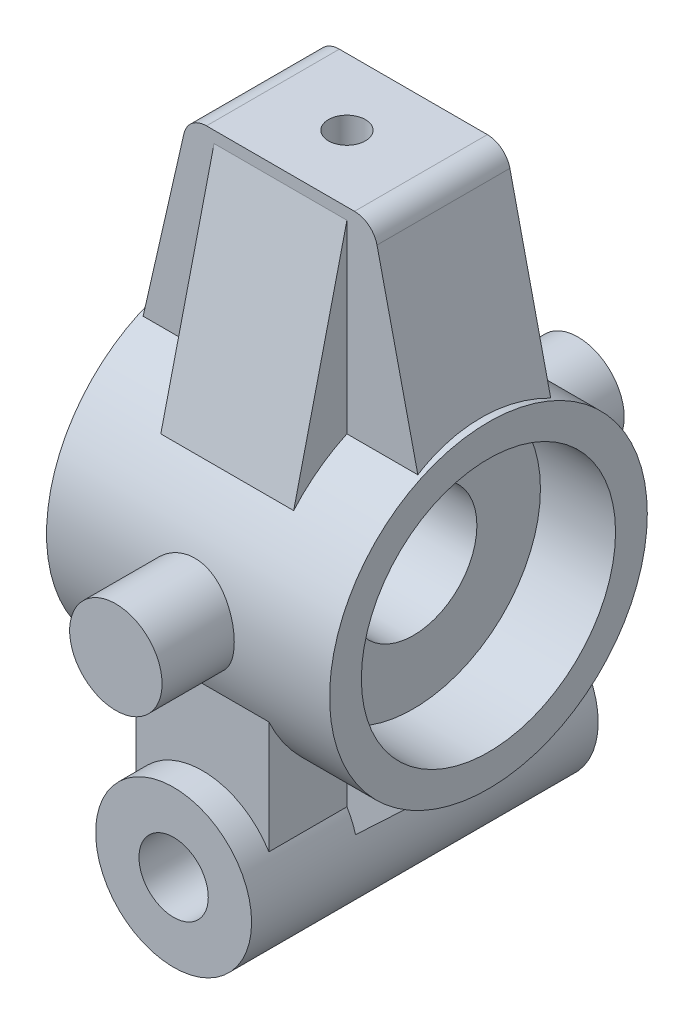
ISO-10303-21;
HEADER;
FILE_DESCRIPTION(('STEP AP214'),'2;1');
FILE_NAME('part.step','',(''),(''),'','','');
FILE_SCHEMA(('AUTOMOTIVE_DESIGN { 1 0 10303 214 1 1 1 1 }'));
ENDSEC;
DATA;
#1=APPLICATION_CONTEXT('core data for automotive mechanical design processes');
#2=APPLICATION_PROTOCOL_DEFINITION('international standard','automotive_design',2000,#1);
#3=PRODUCT_CONTEXT('',#1,'mechanical');
#4=PRODUCT('Part','Part','',(#3));
#5=PRODUCT_RELATED_PRODUCT_CATEGORY('part','',(#4));
#6=PRODUCT_DEFINITION_FORMATION('','',#4);
#7=PRODUCT_DEFINITION_CONTEXT('part definition',#1,'design');
#8=PRODUCT_DEFINITION('design','',#6,#7);
#9=PRODUCT_DEFINITION_SHAPE('','',#8);
#10=(LENGTH_UNIT() NAMED_UNIT(*) SI_UNIT(.MILLI.,.METRE.));
#11=(NAMED_UNIT(*) PLANE_ANGLE_UNIT() SI_UNIT($,.RADIAN.));
#12=(NAMED_UNIT(*) SI_UNIT($,.STERADIAN.) SOLID_ANGLE_UNIT());
#13=UNCERTAINTY_MEASURE_WITH_UNIT(LENGTH_MEASURE(1.E-05),#10,'distance_accuracy_value','');
#14=(GEOMETRIC_REPRESENTATION_CONTEXT(3) GLOBAL_UNCERTAINTY_ASSIGNED_CONTEXT((#13)) GLOBAL_UNIT_ASSIGNED_CONTEXT((#10,
#11,#12)) REPRESENTATION_CONTEXT('',''));
#15=CARTESIAN_POINT('',(0.,0.,0.));
#16=DIRECTION('',(0.,0.,1.));
#17=DIRECTION('',(1.,0.,0.));
#18=AXIS2_PLACEMENT_3D('',#15,#16,#17);
#19=CARTESIAN_POINT('',(0.,17.5,0.));
#20=DIRECTION('',(0.,1.,0.));
#21=DIRECTION('',(0.,0.,1.));
#22=AXIS2_PLACEMENT_3D('',#19,#20,#21);
#23=PLANE('',#22);
#24=CARTESIAN_POINT('',(0.,17.5,0.));
#25=DIRECTION('',(0.,1.,0.));
#26=DIRECTION('',(0.,0.,1.));
#27=AXIS2_PLACEMENT_3D('',#24,#25,#26);
#28=CIRCLE('',#27,1.6);
#29=CARTESIAN_POINT('',(0.,17.5,1.6));
#30=VERTEX_POINT('',#29);
#31=EDGE_CURVE('E20',#30,#30,#28,.T.);
#32=ORIENTED_EDGE('',*,*,#31,.T.);
#33=EDGE_LOOP('',(#32));
#34=FACE_BOUND('',#33,.T.);
#35=ADVANCED_FACE('F16',(#34),#23,.T.);
#36=CARTESIAN_POINT('',(-14.7,0.,0.));
#37=DIRECTION('',(1.,0.,0.));
#38=DIRECTION('',(0.,0.,-1.));
#39=AXIS2_PLACEMENT_3D('',#36,#37,#38);
#40=CYLINDRICAL_SURFACE('',#39,5.5);
#41=CARTESIAN_POINT('',(-5.75,0.,0.));
#42=DIRECTION('',(1.,0.,0.));
#43=DIRECTION('',(0.,0.,-1.));
#44=AXIS2_PLACEMENT_3D('',#41,#42,#43);
#45=CIRCLE('',#44,5.5);
#46=CARTESIAN_POINT('',(-5.75,0.,-5.5));
#47=VERTEX_POINT('',#46);
#48=EDGE_CURVE('E764',#47,#47,#45,.F.);
#49=ORIENTED_EDGE('',*,*,#48,.T.);
#50=EDGE_LOOP('',(#49));
#51=FACE_BOUND('',#50,.T.);
#52=CARTESIAN_POINT('',(5.75,0.,0.));
#53=DIRECTION('',(1.,0.,0.));
#54=DIRECTION('',(0.,0.,-1.));
#55=AXIS2_PLACEMENT_3D('',#52,#53,#54);
#56=CIRCLE('',#55,5.5);
#57=CARTESIAN_POINT('',(5.75,0.,-5.5));
#58=VERTEX_POINT('',#57);
#59=EDGE_CURVE('E343',#58,#58,#56,.F.);
#60=ORIENTED_EDGE('',*,*,#59,.F.);
#61=EDGE_LOOP('',(#60));
#62=FACE_BOUND('',#61,.T.);
#63=ADVANCED_FACE('F745',(#51,#62),#40,.F.);
#64=CARTESIAN_POINT('',(0.,29.5,0.));
#65=DIRECTION('',(0.,1.,0.));
#66=DIRECTION('',(0.,0.,1.));
#67=AXIS2_PLACEMENT_3D('',#64,#65,#66);
#68=CYLINDRICAL_SURFACE('',#67,1.6);
#69=ORIENTED_EDGE('',*,*,#31,.F.);
#70=EDGE_LOOP('',(#69));
#71=FACE_BOUND('',#70,.T.);
#72=CARTESIAN_POINT('',(0.,29.5,0.));
#73=DIRECTION('',(0.,1.,0.));
#74=DIRECTION('',(0.,0.,1.));
#75=AXIS2_PLACEMENT_3D('',#72,#73,#74);
#76=CIRCLE('',#75,1.6);
#77=CARTESIAN_POINT('',(0.,29.5,1.6));
#78=VERTEX_POINT('',#77);
#79=EDGE_CURVE('E339',#78,#78,#76,.F.);
#80=ORIENTED_EDGE('',*,*,#79,.F.);
#81=EDGE_LOOP('',(#80));
#82=FACE_BOUND('',#81,.T.);
#83=ADVANCED_FACE('F737',(#71,#82),#68,.F.);
#84=CARTESIAN_POINT('',(-5.75,0.,0.));
#85=DIRECTION('',(1.,0.,0.));
#86=DIRECTION('',(0.,0.,-1.));
#87=AXIS2_PLACEMENT_3D('',#84,#85,#86);
#88=PLANE('',#87);
#89=ORIENTED_EDGE('',*,*,#48,.F.);
#90=EDGE_LOOP('',(#89));
#91=FACE_BOUND('',#90,.T.);
#92=CARTESIAN_POINT('',(-5.75,0.,0.));
#93=DIRECTION('',(1.,0.,0.));
#94=DIRECTION('',(0.,0.,-1.));
#95=AXIS2_PLACEMENT_3D('',#92,#93,#94);
#96=CIRCLE('',#95,11.);
#97=CARTESIAN_POINT('',(-5.75,0.,-11.));
#98=VERTEX_POINT('',#97);
#99=EDGE_CURVE('E338',#98,#98,#96,.F.);
#100=ORIENTED_EDGE('',*,*,#99,.T.);
#101=EDGE_LOOP('',(#100));
#102=FACE_BOUND('',#101,.T.);
#103=ADVANCED_FACE('F729',(#91,#102),#88,.F.);
#104=CARTESIAN_POINT('',(5.75,0.,0.));
#105=DIRECTION('',(1.,0.,0.));
#106=DIRECTION('',(0.,0.,-1.));
#107=AXIS2_PLACEMENT_3D('',#104,#105,#106);
#108=PLANE('',#107);
#109=ORIENTED_EDGE('',*,*,#59,.T.);
#110=EDGE_LOOP('',(#109));
#111=FACE_BOUND('',#110,.T.);
#112=CARTESIAN_POINT('',(5.75,0.,0.));
#113=DIRECTION('',(1.,0.,0.));
#114=DIRECTION('',(0.,0.,-1.));
#115=AXIS2_PLACEMENT_3D('',#112,#113,#114);
#116=CIRCLE('',#115,11.);
#117=CARTESIAN_POINT('',(5.75,0.,-11.));
#118=VERTEX_POINT('',#117);
#119=EDGE_CURVE('E774',#118,#118,#116,.T.);
#120=ORIENTED_EDGE('',*,*,#119,.T.);
#121=EDGE_LOOP('',(#120));
#122=FACE_BOUND('',#121,.T.);
#123=ADVANCED_FACE('F721',(#111,#122),#108,.T.);
#124=CARTESIAN_POINT('',(6.405563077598,27.5,72.144));
#125=DIRECTION('',(0.,0.,-1.));
#126=DIRECTION('',(-1.,0.,0.));
#127=AXIS2_PLACEMENT_3D('',#124,#125,#126);
#128=CYLINDRICAL_SURFACE('',#127,2.);
#129=DIRECTION('',(0.,0.,1.));
#130=VECTOR('',#129,1.);
#131=CARTESIAN_POINT('',(8.35528009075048,27.9456496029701,-5.75));
#132=LINE('',#131,#130);
#133=CARTESIAN_POINT('',(8.3552800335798,27.9456498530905,-5.75000000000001));
#134=VERTEX_POINT('',#133);
#135=CARTESIAN_POINT('',(8.35528003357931,27.9456498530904,5.75000000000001));
#136=VERTEX_POINT('',#135);
#137=EDGE_CURVE('E317',#134,#136,#132,.T.);
#138=ORIENTED_EDGE('',*,*,#137,.F.);
#139=CARTESIAN_POINT('',(6.405563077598,27.5,-5.75000000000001));
#140=DIRECTION('',(0.,0.,-1.));
#141=DIRECTION('',(-1.,0.,0.));
#142=AXIS2_PLACEMENT_3D('',#139,#140,#141);
#143=CIRCLE('',#142,2.);
#144=CARTESIAN_POINT('',(6.405563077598,29.5,-5.75));
#145=VERTEX_POINT('',#144);
#146=EDGE_CURVE('E335',#134,#145,#143,.F.);
#147=ORIENTED_EDGE('',*,*,#146,.T.);
#148=DIRECTION('',(0.,0.,1.));
#149=VECTOR('',#148,1.);
#150=CARTESIAN_POINT('',(6.405563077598,29.5,-5.75));
#151=LINE('',#150,#149);
#152=CARTESIAN_POINT('',(6.405563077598,29.5,5.75));
#153=VERTEX_POINT('',#152);
#154=EDGE_CURVE('E340',#153,#145,#151,.F.);
#155=ORIENTED_EDGE('',*,*,#154,.F.);
#156=CARTESIAN_POINT('',(6.405563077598,27.5,5.75000000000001));
#157=DIRECTION('',(0.,0.,-1.));
#158=DIRECTION('',(-1.,0.,0.));
#159=AXIS2_PLACEMENT_3D('',#156,#157,#158);
#160=CIRCLE('',#159,2.);
#161=EDGE_CURVE('E780',#136,#153,#160,.F.);
#162=ORIENTED_EDGE('',*,*,#161,.F.);
#163=EDGE_LOOP('',(#138,#147,#155,#162));
#164=FACE_BOUND('',#163,.T.);
#165=ADVANCED_FACE('F713',(#164),#128,.T.);
#166=CARTESIAN_POINT('',(8.,29.5,-5.75));
#167=DIRECTION('',(0.,1.,0.));
#168=DIRECTION('',(0.,0.,1.));
#169=AXIS2_PLACEMENT_3D('',#166,#167,#168);
#170=PLANE('',#169);
#171=ORIENTED_EDGE('',*,*,#79,.T.);
#172=EDGE_LOOP('',(#171));
#173=FACE_BOUND('',#172,.T.);
#174=DIRECTION('',(1.,0.,0.));
#175=VECTOR('',#174,1.);
#176=CARTESIAN_POINT('',(0.,29.5,5.75));
#177=LINE('',#176,#175);
#178=CARTESIAN_POINT('',(-6.405563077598,29.5,5.75));
#179=VERTEX_POINT('',#178);
#180=EDGE_CURVE('E779',#153,#179,#177,.F.);
#181=ORIENTED_EDGE('',*,*,#180,.F.);
#182=ORIENTED_EDGE('',*,*,#154,.T.);
#183=DIRECTION('',(1.,0.,0.));
#184=VECTOR('',#183,1.);
#185=CARTESIAN_POINT('',(0.,29.5,-5.75));
#186=LINE('',#185,#184);
#187=CARTESIAN_POINT('',(-6.405563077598,29.5,-5.75));
#188=VERTEX_POINT('',#187);
#189=EDGE_CURVE('E216',#145,#188,#186,.F.);
#190=ORIENTED_EDGE('',*,*,#189,.T.);
#191=DIRECTION('',(0.,0.,-1.));
#192=VECTOR('',#191,1.);
#193=CARTESIAN_POINT('',(-6.405563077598,29.5,72.144));
#194=LINE('',#193,#192);
#195=EDGE_CURVE('E169',#179,#188,#194,.T.);
#196=ORIENTED_EDGE('',*,*,#195,.F.);
#197=EDGE_LOOP('',(#181,#182,#190,#196));
#198=FACE_BOUND('',#197,.T.);
#199=ADVANCED_FACE('F705',(#173,#198),#170,.T.);
#200=CARTESIAN_POINT('',(-6.405563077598,27.5,72.144));
#201=DIRECTION('',(0.,0.,-1.));
#202=DIRECTION('',(-1.,0.,0.));
#203=AXIS2_PLACEMENT_3D('',#200,#201,#202);
#204=CYLINDRICAL_SURFACE('',#203,2.);
#205=ORIENTED_EDGE('',*,*,#195,.T.);
#206=CARTESIAN_POINT('',(-6.405563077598,27.5,-5.75000000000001));
#207=DIRECTION('',(0.,0.,-1.));
#208=DIRECTION('',(-1.,0.,0.));
#209=AXIS2_PLACEMENT_3D('',#206,#207,#208);
#210=CIRCLE('',#209,2.);
#211=CARTESIAN_POINT('',(-8.3552800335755,27.9456498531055,-5.75000000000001));
#212=VERTEX_POINT('',#211);
#213=EDGE_CURVE('E784',#188,#212,#210,.F.);
#214=ORIENTED_EDGE('',*,*,#213,.T.);
#215=DIRECTION('',(0.,0.,1.));
#216=VECTOR('',#215,1.);
#217=CARTESIAN_POINT('',(-8.35528009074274,27.9456496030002,-5.75));
#218=LINE('',#217,#216);
#219=CARTESIAN_POINT('',(-8.35528009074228,27.9456496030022,5.75));
#220=VERTEX_POINT('',#219);
#221=EDGE_CURVE('E332',#220,#212,#218,.F.);
#222=ORIENTED_EDGE('',*,*,#221,.F.);
#223=CARTESIAN_POINT('',(-6.405563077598,27.5,5.75000000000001));
#224=DIRECTION('',(0.,0.,-1.));
#225=DIRECTION('',(-1.,0.,0.));
#226=AXIS2_PLACEMENT_3D('',#223,#224,#225);
#227=CIRCLE('',#226,2.);
#228=EDGE_CURVE('E307',#179,#220,#227,.F.);
#229=ORIENTED_EDGE('',*,*,#228,.F.);
#230=EDGE_LOOP('',(#205,#214,#222,#229));
#231=FACE_BOUND('',#230,.T.);
#232=ADVANCED_FACE('F697',(#231),#204,.T.);
#233=CARTESIAN_POINT('',(-5.75,0.,0.));
#234=DIRECTION('',(1.,0.,0.));
#235=DIRECTION('',(0.,0.,-1.));
#236=AXIS2_PLACEMENT_3D('',#233,#234,#235);
#237=CYLINDRICAL_SURFACE('',#236,11.);
#238=ORIENTED_EDGE('',*,*,#99,.F.);
#239=EDGE_LOOP('',(#238));
#240=FACE_BOUND('',#239,.T.);
#241=CARTESIAN_POINT('',(-12.25,0.,0.));
#242=DIRECTION('',(1.,0.,0.));
#243=DIRECTION('',(0.,0.,-1.));
#244=AXIS2_PLACEMENT_3D('',#241,#242,#243);
#245=CIRCLE('',#244,11.);
#246=CARTESIAN_POINT('',(-12.25,0.,-11.));
#247=VERTEX_POINT('',#246);
#248=EDGE_CURVE('E209',#247,#247,#245,.F.);
#249=ORIENTED_EDGE('',*,*,#248,.T.);
#250=EDGE_LOOP('',(#249));
#251=FACE_BOUND('',#250,.T.);
#252=ADVANCED_FACE('F689',(#240,#251),#237,.F.);
#253=CARTESIAN_POINT('',(0.,0.,-20.));
#254=DIRECTION('',(0.,0.,1.));
#255=DIRECTION('',(1.,0.,0.));
#256=AXIS2_PLACEMENT_3D('',#253,#254,#255);
#257=PLANE('',#256);
#258=CARTESIAN_POINT('',(0.,0.,-20.));
#259=DIRECTION('',(0.,0.,1.));
#260=DIRECTION('',(1.,0.,0.));
#261=AXIS2_PLACEMENT_3D('',#258,#259,#260);
#262=CIRCLE('',#261,4.);
#263=CARTESIAN_POINT('',(4.,0.,-20.));
#264=VERTEX_POINT('',#263);
#265=EDGE_CURVE('E212',#264,#264,#262,.T.);
#266=ORIENTED_EDGE('',*,*,#265,.F.);
#267=EDGE_LOOP('',(#266));
#268=FACE_BOUND('',#267,.T.);
#269=ADVANCED_FACE('F681',(#268),#257,.F.);
#270=CARTESIAN_POINT('',(5.75,0.,0.));
#271=DIRECTION('',(1.,0.,0.));
#272=DIRECTION('',(0.,0.,-1.));
#273=AXIS2_PLACEMENT_3D('',#270,#271,#272);
#274=CYLINDRICAL_SURFACE('',#273,11.);
#275=ORIENTED_EDGE('',*,*,#119,.F.);
#276=EDGE_LOOP('',(#275));
#277=FACE_BOUND('',#276,.T.);
#278=CARTESIAN_POINT('',(12.25,0.,0.));
#279=DIRECTION('',(1.,0.,0.));
#280=DIRECTION('',(0.,0.,-1.));
#281=AXIS2_PLACEMENT_3D('',#278,#279,#280);
#282=CIRCLE('',#281,11.);
#283=CARTESIAN_POINT('',(12.25,0.,-11.));
#284=VERTEX_POINT('',#283);
#285=EDGE_CURVE('E302',#284,#284,#282,.F.);
#286=ORIENTED_EDGE('',*,*,#285,.F.);
#287=EDGE_LOOP('',(#286));
#288=FACE_BOUND('',#287,.T.);
#289=ADVANCED_FACE('F674',(#277,#288),#274,.F.);
#290=CARTESIAN_POINT('',(-5.75,0.,-12.5));
#291=DIRECTION('',(0.,0.230466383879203,-0.973080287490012));
#292=DIRECTION('',(0.,0.973080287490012,0.230466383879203));
#293=AXIS2_PLACEMENT_3D('',#290,#291,#292);
#294=PLANE('',#293);
#295=DIRECTION('',(0.,0.973080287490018,0.230466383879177));
#296=VECTOR('',#295,1.);
#297=CARTESIAN_POINT('',(5.75,9.042512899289,-10.35835220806));
#298=LINE('',#297,#296);
#299=CARTESIAN_POINT('',(5.75,9.04251289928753,-10.3583522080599));
#300=VERTEX_POINT('',#299);
#301=CARTESIAN_POINT('',(5.75,28.49999999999,-5.75));
#302=VERTEX_POINT('',#301);
#303=EDGE_CURVE('E331',#300,#302,#298,.T.);
#304=ORIENTED_EDGE('',*,*,#303,.F.);
#305=DIRECTION('',(1.,0.,0.));
#306=VECTOR('',#305,1.);
#307=CARTESIAN_POINT('',(-12.25,9.0425128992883,-10.3583522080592));
#308=LINE('',#307,#306);
#309=CARTESIAN_POINT('',(-5.75,9.04251289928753,-10.3583522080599));
#310=VERTEX_POINT('',#309);
#311=EDGE_CURVE('E190',#310,#300,#308,.T.);
#312=ORIENTED_EDGE('',*,*,#311,.F.);
#313=DIRECTION('',(0.,0.973080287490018,0.230466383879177));
#314=VECTOR('',#313,1.);
#315=CARTESIAN_POINT('',(-5.75,9.042512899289,-10.35835220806));
#316=LINE('',#315,#314);
#317=CARTESIAN_POINT('',(-5.75,28.49999999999,-5.75));
#318=VERTEX_POINT('',#317);
#319=EDGE_CURVE('E187',#310,#318,#316,.T.);
#320=ORIENTED_EDGE('',*,*,#319,.T.);
#321=DIRECTION('',(1.,0.,0.));
#322=VECTOR('',#321,1.);
#323=CARTESIAN_POINT('',(0.,28.49999999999,-5.75));
#324=LINE('',#323,#322);
#325=EDGE_CURVE('E184',#318,#302,#324,.T.);
#326=ORIENTED_EDGE('',*,*,#325,.T.);
#327=EDGE_LOOP('',(#304,#312,#320,#326));
#328=FACE_BOUND('',#327,.T.);
#329=ADVANCED_FACE('F188',(#328),#294,.T.);
#330=CARTESIAN_POINT('',(5.75,0.,0.));
#331=DIRECTION('',(1.,0.,0.));
#332=DIRECTION('',(0.,0.,-1.));
#333=AXIS2_PLACEMENT_3D('',#330,#331,#332);
#334=PLANE('',#333);
#335=DIRECTION('',(0.,1.,0.));
#336=VECTOR('',#335,1.);
#337=CARTESIAN_POINT('',(5.75,0.,-5.75));
#338=LINE('',#337,#336);
#339=CARTESIAN_POINT('',(5.75,12.4899959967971,-5.74999999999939));
#340=VERTEX_POINT('',#339);
#341=EDGE_CURVE('E203',#302,#340,#338,.F.);
#342=ORIENTED_EDGE('',*,*,#341,.T.);
#343=CARTESIAN_POINT('',(5.75,0.,0.));
#344=DIRECTION('',(1.,0.,0.));
#345=DIRECTION('',(0.,0.,-1.));
#346=AXIS2_PLACEMENT_3D('',#343,#344,#345);
#347=CIRCLE('',#346,13.75);
#348=EDGE_CURVE('E301',#300,#340,#347,.T.);
#349=ORIENTED_EDGE('',*,*,#348,.F.);
#350=ORIENTED_EDGE('',*,*,#303,.T.);
#351=EDGE_LOOP('',(#342,#349,#350));
#352=FACE_BOUND('',#351,.T.);
#353=ADVANCED_FACE('F659',(#352),#334,.T.);
#354=CARTESIAN_POINT('',(12.,12.,-5.75));
#355=DIRECTION('',(0.974858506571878,0.222824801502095,0.));
#356=DIRECTION('',(-0.222824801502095,0.974858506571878,0.));
#357=AXIS2_PLACEMENT_3D('',#354,#355,#356);
#358=PLANE('',#357);
#359=DIRECTION('',(-0.222825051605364,0.974858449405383,0.));
#360=VECTOR('',#359,1.);
#361=CARTESIAN_POINT('',(11.88800998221,12.48997458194,-5.75));
#362=LINE('',#361,#360);
#363=CARTESIAN_POINT('',(11.8880030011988,12.4899959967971,-5.74999999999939));
#364=VERTEX_POINT('',#363);
#365=EDGE_CURVE('E196',#364,#134,#362,.T.);
#366=ORIENTED_EDGE('',*,*,#365,.T.);
#367=ORIENTED_EDGE('',*,*,#137,.T.);
#368=DIRECTION('',(-0.222825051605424,0.974858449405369,0.));
#369=VECTOR('',#368,1.);
#370=CARTESIAN_POINT('',(11.88800998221,12.48997458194,5.75));
#371=LINE('',#370,#369);
#372=CARTESIAN_POINT('',(11.8880030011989,12.4899959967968,5.75));
#373=VERTEX_POINT('',#372);
#374=EDGE_CURVE('E322',#373,#136,#371,.T.);
#375=ORIENTED_EDGE('',*,*,#374,.F.);
#376=CARTESIAN_POINT('',(14.7428571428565,0.,0.));
#377=DIRECTION('',(0.974858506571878,0.222824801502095,0.));
#378=DIRECTION('',(0.222824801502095,-0.974858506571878,0.));
#379=AXIS2_PLACEMENT_3D('',#376,#377,#378);
#380=ELLIPSE('',#379,14.1046109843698,13.75);
#381=EDGE_CURVE('E794',#364,#373,#380,.T.);
#382=ORIENTED_EDGE('',*,*,#381,.F.);
#383=EDGE_LOOP('',(#366,#367,#375,#382));
#384=FACE_BOUND('',#383,.T.);
#385=ADVANCED_FACE('F651',(#384),#358,.T.);
#386=CARTESIAN_POINT('',(5.75,0.,0.));
#387=DIRECTION('',(1.,0.,0.));
#388=DIRECTION('',(0.,0.,-1.));
#389=AXIS2_PLACEMENT_3D('',#386,#387,#388);
#390=PLANE('',#389);
#391=DIRECTION('',(0.,-0.973080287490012,0.230466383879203));
#392=VECTOR('',#391,1.);
#393=CARTESIAN_POINT('',(5.75,28.5,5.75));
#394=LINE('',#393,#392);
#395=CARTESIAN_POINT('',(5.75,9.04251289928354,10.3583522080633));
#396=VERTEX_POINT('',#395);
#397=CARTESIAN_POINT('',(5.75,28.5,5.75));
#398=VERTEX_POINT('',#397);
#399=EDGE_CURVE('E315',#396,#398,#394,.F.);
#400=ORIENTED_EDGE('',*,*,#399,.F.);
#401=CARTESIAN_POINT('',(5.75,0.,0.));
#402=DIRECTION('',(1.,0.,0.));
#403=DIRECTION('',(0.,0.,-1.));
#404=AXIS2_PLACEMENT_3D('',#401,#402,#403);
#405=CIRCLE('',#404,13.75);
#406=CARTESIAN_POINT('',(5.75,12.4899959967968,5.75));
#407=VERTEX_POINT('',#406);
#408=EDGE_CURVE('E314',#407,#396,#405,.T.);
#409=ORIENTED_EDGE('',*,*,#408,.F.);
#410=DIRECTION('',(0.,1.,0.));
#411=VECTOR('',#410,1.);
#412=CARTESIAN_POINT('',(5.75,0.,5.75));
#413=LINE('',#412,#411);
#414=EDGE_CURVE('E320',#398,#407,#413,.F.);
#415=ORIENTED_EDGE('',*,*,#414,.F.);
#416=EDGE_LOOP('',(#400,#409,#415));
#417=FACE_BOUND('',#416,.T.);
#418=ADVANCED_FACE('F643',(#417),#390,.T.);
#419=CARTESIAN_POINT('',(-5.75,28.5,5.75));
#420=DIRECTION('',(0.,0.230466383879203,0.973080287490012));
#421=DIRECTION('',(0.,-0.973080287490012,0.230466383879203));
#422=AXIS2_PLACEMENT_3D('',#419,#420,#421);
#423=PLANE('',#422);
#424=DIRECTION('',(0.,-0.973080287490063,0.230466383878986));
#425=VECTOR('',#424,1.);
#426=CARTESIAN_POINT('',(-5.75,28.5,5.75));
#427=LINE('',#426,#425);
#428=CARTESIAN_POINT('',(-5.75,28.5,5.75000000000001));
#429=VERTEX_POINT('',#428);
#430=CARTESIAN_POINT('',(-5.75,9.04251289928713,10.3583522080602));
#431=VERTEX_POINT('',#430);
#432=EDGE_CURVE('E175',#429,#431,#427,.T.);
#433=ORIENTED_EDGE('',*,*,#432,.T.);
#434=DIRECTION('',(1.,0.,0.));
#435=VECTOR('',#434,1.);
#436=CARTESIAN_POINT('',(-12.25,9.04251289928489,10.3583522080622));
#437=LINE('',#436,#435);
#438=EDGE_CURVE('E310',#396,#431,#437,.F.);
#439=ORIENTED_EDGE('',*,*,#438,.F.);
#440=ORIENTED_EDGE('',*,*,#399,.T.);
#441=DIRECTION('',(1.,0.,0.));
#442=VECTOR('',#441,1.);
#443=CARTESIAN_POINT('',(0.,28.5,5.75));
#444=LINE('',#443,#442);
#445=EDGE_CURVE('E306',#429,#398,#444,.T.);
#446=ORIENTED_EDGE('',*,*,#445,.F.);
#447=EDGE_LOOP('',(#433,#439,#440,#446));
#448=FACE_BOUND('',#447,.T.);
#449=ADVANCED_FACE('F636',(#448),#423,.T.);
#450=CARTESIAN_POINT('',(-5.75,0.,0.));
#451=DIRECTION('',(1.,0.,0.));
#452=DIRECTION('',(0.,0.,-1.));
#453=AXIS2_PLACEMENT_3D('',#450,#451,#452);
#454=PLANE('',#453);
#455=DIRECTION('',(0.,1.,0.));
#456=VECTOR('',#455,1.);
#457=CARTESIAN_POINT('',(-5.75,0.,5.75));
#458=LINE('',#457,#456);
#459=CARTESIAN_POINT('',(-5.75,12.4899959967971,5.74999999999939));
#460=VERTEX_POINT('',#459);
#461=EDGE_CURVE('E303',#460,#429,#458,.T.);
#462=ORIENTED_EDGE('',*,*,#461,.F.);
#463=CARTESIAN_POINT('',(-5.75,0.,0.));
#464=DIRECTION('',(1.,0.,0.));
#465=DIRECTION('',(0.,0.,-1.));
#466=AXIS2_PLACEMENT_3D('',#463,#464,#465);
#467=CIRCLE('',#466,13.75);
#468=EDGE_CURVE('E313',#431,#460,#467,.F.);
#469=ORIENTED_EDGE('',*,*,#468,.F.);
#470=ORIENTED_EDGE('',*,*,#432,.F.);
#471=EDGE_LOOP('',(#462,#469,#470));
#472=FACE_BOUND('',#471,.T.);
#473=ADVANCED_FACE('F628',(#472),#454,.F.);
#474=CARTESIAN_POINT('',(0.,0.,5.75));
#475=DIRECTION('',(0.,0.,1.));
#476=DIRECTION('',(1.,0.,0.));
#477=AXIS2_PLACEMENT_3D('',#474,#475,#476);
#478=PLANE('',#477);
#479=ORIENTED_EDGE('',*,*,#374,.T.);
#480=ORIENTED_EDGE('',*,*,#161,.T.);
#481=ORIENTED_EDGE('',*,*,#180,.T.);
#482=ORIENTED_EDGE('',*,*,#228,.T.);
#483=DIRECTION('',(-0.222824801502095,-0.974858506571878,0.));
#484=VECTOR('',#483,1.);
#485=CARTESIAN_POINT('',(-8.,29.5,5.75));
#486=LINE('',#485,#484);
#487=CARTESIAN_POINT('',(-11.888000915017,12.4899959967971,5.74999999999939));
#488=VERTEX_POINT('',#487);
#489=EDGE_CURVE('E336',#488,#220,#486,.F.);
#490=ORIENTED_EDGE('',*,*,#489,.F.);
#491=DIRECTION('',(1.,0.,0.));
#492=VECTOR('',#491,1.);
#493=CARTESIAN_POINT('',(-12.25,12.4899959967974,5.74999999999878));
#494=LINE('',#493,#492);
#495=EDGE_CURVE('E804',#460,#488,#494,.F.);
#496=ORIENTED_EDGE('',*,*,#495,.F.);
#497=ORIENTED_EDGE('',*,*,#461,.T.);
#498=ORIENTED_EDGE('',*,*,#445,.T.);
#499=ORIENTED_EDGE('',*,*,#414,.T.);
#500=DIRECTION('',(1.,0.,0.));
#501=VECTOR('',#500,1.);
#502=CARTESIAN_POINT('',(11.8880089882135,12.4899959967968,5.75));
#503=LINE('',#502,#501);
#504=EDGE_CURVE('E797',#373,#407,#503,.F.);
#505=ORIENTED_EDGE('',*,*,#504,.F.);
#506=EDGE_LOOP('',(#479,#480,#481,#482,#490,#496,#497,#498,#499,#505));
#507=FACE_BOUND('',#506,.T.);
#508=ADVANCED_FACE('F620',(#507),#478,.T.);
#509=CARTESIAN_POINT('',(-8.,29.5,-5.75));
#510=DIRECTION('',(-0.974858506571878,0.222824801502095,0.));
#511=DIRECTION('',(-0.222824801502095,-0.974858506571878,0.));
#512=AXIS2_PLACEMENT_3D('',#509,#510,#511);
#513=PLANE('',#512);
#514=ORIENTED_EDGE('',*,*,#489,.T.);
#515=ORIENTED_EDGE('',*,*,#221,.T.);
#516=DIRECTION('',(-0.222825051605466,-0.974858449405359,0.));
#517=VECTOR('',#516,1.);
#518=CARTESIAN_POINT('',(-8.35528009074,27.94564960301,-5.75));
#519=LINE('',#518,#517);
#520=CARTESIAN_POINT('',(-11.8880030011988,12.4899959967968,-5.75));
#521=VERTEX_POINT('',#520);
#522=EDGE_CURVE('E204',#212,#521,#519,.T.);
#523=ORIENTED_EDGE('',*,*,#522,.T.);
#524=CARTESIAN_POINT('',(-14.7428571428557,0.,0.));
#525=DIRECTION('',(-0.974858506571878,0.222824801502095,0.));
#526=DIRECTION('',(0.222824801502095,0.974858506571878,0.));
#527=AXIS2_PLACEMENT_3D('',#524,#525,#526);
#528=ELLIPSE('',#527,14.1046109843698,13.75);
#529=EDGE_CURVE('E807',#488,#521,#528,.T.);
#530=ORIENTED_EDGE('',*,*,#529,.F.);
#531=EDGE_LOOP('',(#514,#515,#523,#530));
#532=FACE_BOUND('',#531,.T.);
#533=ADVANCED_FACE('F613',(#532),#513,.T.);
#534=CARTESIAN_POINT('',(0.,0.,-5.75));
#535=DIRECTION('',(0.,0.,1.));
#536=DIRECTION('',(1.,0.,0.));
#537=AXIS2_PLACEMENT_3D('',#534,#535,#536);
#538=PLANE('',#537);
#539=DIRECTION('',(1.,0.,0.));
#540=VECTOR('',#539,1.);
#541=CARTESIAN_POINT('',(-12.25,12.4899959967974,-5.74999999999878));
#542=LINE('',#541,#540);
#543=EDGE_CURVE('E791',#340,#364,#542,.T.);
#544=ORIENTED_EDGE('',*,*,#543,.F.);
#545=ORIENTED_EDGE('',*,*,#341,.F.);
#546=ORIENTED_EDGE('',*,*,#325,.F.);
#547=DIRECTION('',(0.,1.,0.));
#548=VECTOR('',#547,1.);
#549=CARTESIAN_POINT('',(-5.75,0.,-5.75));
#550=LINE('',#549,#548);
#551=CARTESIAN_POINT('',(-5.75,12.4899959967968,-5.75));
#552=VERTEX_POINT('',#551);
#553=EDGE_CURVE('E195',#318,#552,#550,.F.);
#554=ORIENTED_EDGE('',*,*,#553,.T.);
#555=DIRECTION('',(1.,0.,0.));
#556=VECTOR('',#555,1.);
#557=CARTESIAN_POINT('',(-11.8880089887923,12.4899959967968,-5.75));
#558=LINE('',#557,#556);
#559=EDGE_CURVE('E810',#521,#552,#558,.T.);
#560=ORIENTED_EDGE('',*,*,#559,.F.);
#561=ORIENTED_EDGE('',*,*,#522,.F.);
#562=ORIENTED_EDGE('',*,*,#213,.F.);
#563=ORIENTED_EDGE('',*,*,#189,.F.);
#564=ORIENTED_EDGE('',*,*,#146,.F.);
#565=ORIENTED_EDGE('',*,*,#365,.F.);
#566=EDGE_LOOP('',(#544,#545,#546,#554,#560,#561,#562,#563,#564,#565));
#567=FACE_BOUND('',#566,.T.);
#568=ADVANCED_FACE('F201',(#567),#538,.F.);
#569=CARTESIAN_POINT('',(-5.75,0.,0.));
#570=DIRECTION('',(1.,0.,0.));
#571=DIRECTION('',(0.,0.,-1.));
#572=AXIS2_PLACEMENT_3D('',#569,#570,#571);
#573=PLANE('',#572);
#574=ORIENTED_EDGE('',*,*,#319,.F.);
#575=CARTESIAN_POINT('',(-5.75,0.,0.));
#576=DIRECTION('',(1.,0.,0.));
#577=DIRECTION('',(0.,0.,-1.));
#578=AXIS2_PLACEMENT_3D('',#575,#576,#577);
#579=CIRCLE('',#578,13.75);
#580=EDGE_CURVE('E207',#552,#310,#579,.F.);
#581=ORIENTED_EDGE('',*,*,#580,.F.);
#582=ORIENTED_EDGE('',*,*,#553,.F.);
#583=EDGE_LOOP('',(#574,#581,#582));
#584=FACE_BOUND('',#583,.T.);
#585=ADVANCED_FACE('F206',(#584),#573,.F.);
#586=CARTESIAN_POINT('',(0.,0.,20.));
#587=DIRECTION('',(0.,0.,1.));
#588=DIRECTION('',(1.,0.,0.));
#589=AXIS2_PLACEMENT_3D('',#586,#587,#588);
#590=PLANE('',#589);
#591=CARTESIAN_POINT('',(0.,0.,20.));
#592=DIRECTION('',(0.,0.,1.));
#593=DIRECTION('',(1.,0.,0.));
#594=AXIS2_PLACEMENT_3D('',#591,#592,#593);
#595=CIRCLE('',#594,4.);
#596=CARTESIAN_POINT('',(4.,0.,20.));
#597=VERTEX_POINT('',#596);
#598=EDGE_CURVE('E812',#597,#597,#595,.F.);
#599=ORIENTED_EDGE('',*,*,#598,.F.);
#600=EDGE_LOOP('',(#599));
#601=FACE_BOUND('',#600,.T.);
#602=ADVANCED_FACE('F594',(#601),#590,.T.);
#603=CARTESIAN_POINT('',(-12.25,0.,0.));
#604=DIRECTION('',(1.,0.,0.));
#605=DIRECTION('',(0.,0.,-1.));
#606=AXIS2_PLACEMENT_3D('',#603,#604,#605);
#607=PLANE('',#606);
#608=ORIENTED_EDGE('',*,*,#248,.F.);
#609=EDGE_LOOP('',(#608));
#610=FACE_BOUND('',#609,.T.);
#611=CARTESIAN_POINT('',(-12.25,0.,0.));
#612=DIRECTION('',(1.,0.,0.));
#613=DIRECTION('',(0.,0.,-1.));
#614=AXIS2_PLACEMENT_3D('',#611,#612,#613);
#615=CIRCLE('',#614,13.75);
#616=CARTESIAN_POINT('',(-12.25,0.,-13.75));
#617=VERTEX_POINT('',#616);
#618=EDGE_CURVE('E398',#617,#617,#615,.T.);
#619=ORIENTED_EDGE('',*,*,#618,.F.);
#620=EDGE_LOOP('',(#619));
#621=FACE_BOUND('',#620,.T.);
#622=ADVANCED_FACE('F405',(#610,#621),#607,.F.);
#623=CARTESIAN_POINT('',(0.,0.,-20.));
#624=DIRECTION('',(0.,0.,1.));
#625=DIRECTION('',(1.,0.,0.));
#626=AXIS2_PLACEMENT_3D('',#623,#624,#625);
#627=CYLINDRICAL_SURFACE('',#626,4.);
#628=ORIENTED_EDGE('',*,*,#265,.T.);
#629=EDGE_LOOP('',(#628));
#630=FACE_BOUND('',#629,.T.);
#631=CARTESIAN_POINT('',(-4.,0.,-13.75));
#632=CARTESIAN_POINT('',(-3.999999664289,-0.109776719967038,-13.7499997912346));
#633=CARTESIAN_POINT('',(-3.99547683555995,-0.219559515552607,-13.7486820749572));
#634=CARTESIAN_POINT('',(-3.97742376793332,-0.438358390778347,-13.7434466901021));
#635=CARTESIAN_POINT('',(-3.96388988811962,-0.54737414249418,-13.7395279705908));
#636=CARTESIAN_POINT('',(-3.92790282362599,-0.763964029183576,-13.7291886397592));
#637=CARTESIAN_POINT('',(-3.90543741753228,-0.871535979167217,-13.7227646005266));
#638=CARTESIAN_POINT('',(-3.85179086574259,-1.08432939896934,-13.7075943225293));
#639=CARTESIAN_POINT('',(-3.82060636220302,-1.18954994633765,-13.6988471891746));
#640=CARTESIAN_POINT('',(-3.71449106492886,-1.50007434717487,-13.6695006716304));
#641=CARTESIAN_POINT('',(-3.62688527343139,-1.70091484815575,-13.6457618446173));
#642=CARTESIAN_POINT('',(-3.42065013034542,-2.08488027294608,-13.5924054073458));
#643=CARTESIAN_POINT('',(-3.30202676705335,-2.26800860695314,-13.5627889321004));
#644=CARTESIAN_POINT('',(-3.03366077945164,-2.61656816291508,-13.4999331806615));
#645=CARTESIAN_POINT('',(-2.88322485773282,-2.78145368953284,-13.4666227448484));
#646=CARTESIAN_POINT('',(-2.55698496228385,-3.08404860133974,-13.400566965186));
#647=CARTESIAN_POINT('',(-2.38117564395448,-3.22175224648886,-13.367821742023));
#648=CARTESIAN_POINT('',(-2.00466145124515,-3.46887207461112,-13.3058648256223));
#649=CARTESIAN_POINT('',(-1.80351272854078,-3.57763626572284,-13.2767413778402));
#650=CARTESIAN_POINT('',(-1.38479838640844,-3.75957521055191,-13.2263778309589));
#651=CARTESIAN_POINT('',(-1.16723656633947,-3.83275817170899,-13.2051359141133));
#652=CARTESIAN_POINT('',(-0.727952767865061,-3.93951912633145,-13.1736757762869));
#653=CARTESIAN_POINT('',(-0.506493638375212,-3.97409485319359,-13.1631804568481));
#654=CARTESIAN_POINT('',(-0.0606883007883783,-4.00577385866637,-13.1535764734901));
#655=CARTESIAN_POINT('',(0.16365724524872,-4.00288558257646,-13.154465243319));
#656=CARTESIAN_POINT('',(0.600846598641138,-3.96050496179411,-13.1672826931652));
#657=CARTESIAN_POINT('',(0.813823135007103,-3.92225039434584,-13.1788380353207));
#658=CARTESIAN_POINT('',(1.23019628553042,-3.81221691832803,-13.2110845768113));
#659=CARTESIAN_POINT('',(1.43359194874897,-3.74043468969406,-13.2317766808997));
#660=CARTESIAN_POINT('',(1.82811602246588,-3.56444514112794,-13.28027210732));
#661=CARTESIAN_POINT('',(2.01904945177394,-3.45982645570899,-13.3081648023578));
#662=CARTESIAN_POINT('',(2.38106252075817,-3.22141703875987,-13.3678728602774));
#663=CARTESIAN_POINT('',(2.55213879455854,-3.08762137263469,-13.3996888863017));
#664=CARTESIAN_POINT('',(2.87658788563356,-2.78851676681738,-13.4651772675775));
#665=CARTESIAN_POINT('',(3.02901071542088,-2.62218275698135,-13.4988736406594));
#666=CARTESIAN_POINT('',(3.30411618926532,-2.26571081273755,-13.5632492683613));
#667=CARTESIAN_POINT('',(3.42678607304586,-2.07556271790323,-13.5939272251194));
#668=CARTESIAN_POINT('',(3.58598239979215,-1.77586775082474,-13.6352170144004));
#669=CARTESIAN_POINT('',(3.63505465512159,-1.67312998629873,-13.6482336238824));
#670=CARTESIAN_POINT('',(3.72433002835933,-1.46366090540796,-13.6722814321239));
#671=CARTESIAN_POINT('',(3.76453674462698,-1.35693122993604,-13.6833134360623));
#672=CARTESIAN_POINT('',(3.83567773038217,-1.1404153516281,-13.7030565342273));
#673=CARTESIAN_POINT('',(3.86662684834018,-1.03063435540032,-13.7117713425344));
#674=CARTESIAN_POINT('',(3.91905356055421,-0.808708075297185,-13.7266473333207));
#675=CARTESIAN_POINT('',(3.94053548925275,-0.696563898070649,-13.7328096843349));
#676=CARTESIAN_POINT('',(3.97142633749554,-0.487130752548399,-13.74170820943));
#677=CARTESIAN_POINT('',(3.98213455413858,-0.390046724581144,-13.744811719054));
#678=CARTESIAN_POINT('',(3.99642154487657,-0.195310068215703,-13.7489577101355));
#679=CARTESIAN_POINT('',(4.00000029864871,-0.0976574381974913,-13.7500001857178));
#680=CARTESIAN_POINT('',(3.999999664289,0.109776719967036,-13.7499997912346));
#681=CARTESIAN_POINT('',(3.99547683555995,0.219559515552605,-13.7486820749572));
#682=CARTESIAN_POINT('',(3.97742376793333,0.438358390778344,-13.7434466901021));
#683=CARTESIAN_POINT('',(3.96388988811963,0.547374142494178,-13.7395279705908));
#684=CARTESIAN_POINT('',(3.92790282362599,0.763964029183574,-13.7291886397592));
#685=CARTESIAN_POINT('',(3.90543741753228,0.871535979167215,-13.7227646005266));
#686=CARTESIAN_POINT('',(3.85179086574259,1.08432939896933,-13.7075943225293));
#687=CARTESIAN_POINT('',(3.82060636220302,1.18954994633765,-13.6988471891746));
#688=CARTESIAN_POINT('',(3.71449106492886,1.50007434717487,-13.6695006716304));
#689=CARTESIAN_POINT('',(3.62688527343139,1.70091484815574,-13.6457618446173));
#690=CARTESIAN_POINT('',(3.42065013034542,2.08488027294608,-13.5924054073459));
#691=CARTESIAN_POINT('',(3.30202676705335,2.26800860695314,-13.5627889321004));
#692=CARTESIAN_POINT('',(3.03366077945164,2.61656816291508,-13.4999331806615));
#693=CARTESIAN_POINT('',(2.88322485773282,2.78145368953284,-13.4666227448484));
#694=CARTESIAN_POINT('',(2.55698496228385,3.08404860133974,-13.400566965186));
#695=CARTESIAN_POINT('',(2.38117564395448,3.22175224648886,-13.367821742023));
#696=CARTESIAN_POINT('',(2.00466145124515,3.46887207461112,-13.3058648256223));
#697=CARTESIAN_POINT('',(1.80351272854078,3.57763626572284,-13.2767413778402));
#698=CARTESIAN_POINT('',(1.38479838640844,3.75957521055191,-13.2263778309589));
#699=CARTESIAN_POINT('',(1.16723656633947,3.83275817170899,-13.2051359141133));
#700=CARTESIAN_POINT('',(0.727952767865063,3.93951912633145,-13.1736757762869));
#701=CARTESIAN_POINT('',(0.506493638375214,3.97409485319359,-13.1631804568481));
#702=CARTESIAN_POINT('',(0.0606883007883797,4.00577385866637,-13.1535764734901));
#703=CARTESIAN_POINT('',(-0.163657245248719,4.00288558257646,-13.154465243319));
#704=CARTESIAN_POINT('',(-0.600846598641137,3.96050496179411,-13.1672826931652));
#705=CARTESIAN_POINT('',(-0.813823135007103,3.92225039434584,-13.1788380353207));
#706=CARTESIAN_POINT('',(-1.23019628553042,3.81221691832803,-13.2110845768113));
#707=CARTESIAN_POINT('',(-1.43359194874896,3.74043468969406,-13.2317766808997));
#708=CARTESIAN_POINT('',(-1.82811602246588,3.56444514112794,-13.28027210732));
#709=CARTESIAN_POINT('',(-2.01904945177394,3.45982645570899,-13.3081648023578));
#710=CARTESIAN_POINT('',(-2.38106252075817,3.22141703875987,-13.3678728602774));
#711=CARTESIAN_POINT('',(-2.55213879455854,3.08762137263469,-13.3996888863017));
#712=CARTESIAN_POINT('',(-2.87658788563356,2.78851676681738,-13.4651772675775));
#713=CARTESIAN_POINT('',(-3.02901071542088,2.62218275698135,-13.4988736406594));
#714=CARTESIAN_POINT('',(-3.30411618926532,2.26571081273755,-13.5632492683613));
#715=CARTESIAN_POINT('',(-3.42678607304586,2.07556271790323,-13.5939272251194));
#716=CARTESIAN_POINT('',(-3.58598239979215,1.77586775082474,-13.6352170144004));
#717=CARTESIAN_POINT('',(-3.63505465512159,1.67312998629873,-13.6482336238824));
#718=CARTESIAN_POINT('',(-3.72433002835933,1.46366090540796,-13.6722814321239));
#719=CARTESIAN_POINT('',(-3.76453674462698,1.35693122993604,-13.6833134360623));
#720=CARTESIAN_POINT('',(-3.83567773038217,1.1404153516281,-13.7030565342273));
#721=CARTESIAN_POINT('',(-3.86662684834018,1.03063435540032,-13.7117713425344));
#722=CARTESIAN_POINT('',(-3.91905356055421,0.808708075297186,-13.7266473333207));
#723=CARTESIAN_POINT('',(-3.94053548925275,0.69656389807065,-13.7328096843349));
#724=CARTESIAN_POINT('',(-3.97142633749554,0.4871307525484,-13.74170820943));
#725=CARTESIAN_POINT('',(-3.98213455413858,0.390046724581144,-13.744811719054));
#726=CARTESIAN_POINT('',(-3.99642154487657,0.195310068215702,-13.7489577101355));
#727=CARTESIAN_POINT('',(-4.00000029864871,0.0976574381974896,-13.7500001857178));
#728=CARTESIAN_POINT('',(-4.,0.,-13.75));
#729=B_SPLINE_CURVE_WITH_KNOTS('',3,(#631,#632,#633,#634,#635,#636,#637,#638,#639,#640,#641,
#642,#643,#644,#645,#646,#647,#648,#649,#650,#651,#652,#653,#654,#655,#656,#657,#658,#659,#660,
#661,#662,#663,#664,#665,#666,#667,#668,#669,#670,#671,#672,#673,#674,#675,#676,#677,#678,#679,
#680,#681,#682,#683,#684,#685,#686,#687,#688,#689,#690,#691,#692,#693,#694,#695,#696,#697,#698,
#699,#700,#701,#702,#703,#704,#705,#706,#707,#708,#709,#710,#711,#712,#713,#714,#715,#716,#717,
#718,#719,#720,#721,#722,#723,#724,#725,#726,#727,#728),.UNSPECIFIED.,.T.,.F.,(4,2,2,2,2,2,2,2,
2,2,2,2,2,2,2,2,2,2,2,2,2,2,2,2,2,2,2,2,2,2,2,2,2,2,2,2,2,2,2,2,2,2,2,2,2,2,2,2,4),(0.,
0.32923923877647,0.658611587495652,0.988436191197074,1.31838799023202,1.97626490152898,
2.63401489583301,3.30793382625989,3.98199491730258,4.67015642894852,5.35815912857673,
6.02793756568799,6.69756502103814,7.34460892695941,7.99171691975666,8.64727904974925,
9.30295213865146,9.98418265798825,10.6657048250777,11.0091425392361,11.3524406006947,
11.6951850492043,12.0377724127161,12.3306630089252,12.6235544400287,12.9527936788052,
13.2821660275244,13.6119906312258,13.9419424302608,14.5998193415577,15.2575693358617,
15.9314882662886,16.6055493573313,17.2937108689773,17.9817135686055,18.6514920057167,
19.3211194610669,19.9681633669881,20.6152713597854,21.270833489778,21.9265065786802,
22.607737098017,23.2892592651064,23.6326969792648,23.9759950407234,24.318739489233,
24.6613268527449,24.9542174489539,25.2471088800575),.UNSPECIFIED.);
#730=CARTESIAN_POINT('',(-4.,0.,-13.75));
#731=VERTEX_POINT('',#730);
#732=EDGE_CURVE('E392',#731,#731,#729,.T.);
#733=ORIENTED_EDGE('',*,*,#732,.F.);
#734=EDGE_LOOP('',(#733));
#735=FACE_BOUND('',#734,.T.);
#736=ADVANCED_FACE('F400',(#630,#735),#627,.T.);
#737=CARTESIAN_POINT('',(12.25,0.,0.));
#738=DIRECTION('',(1.,0.,0.));
#739=DIRECTION('',(0.,0.,-1.));
#740=AXIS2_PLACEMENT_3D('',#737,#738,#739);
#741=PLANE('',#740);
#742=ORIENTED_EDGE('',*,*,#285,.T.);
#743=EDGE_LOOP('',(#742));
#744=FACE_BOUND('',#743,.T.);
#745=CARTESIAN_POINT('',(12.25,0.,0.));
#746=DIRECTION('',(1.,0.,0.));
#747=DIRECTION('',(0.,0.,-1.));
#748=AXIS2_PLACEMENT_3D('',#745,#746,#747);
#749=CIRCLE('',#748,13.75);
#750=CARTESIAN_POINT('',(12.25,0.,-13.75));
#751=VERTEX_POINT('',#750);
#752=EDGE_CURVE('E379',#751,#751,#749,.F.);
#753=ORIENTED_EDGE('',*,*,#752,.F.);
#754=EDGE_LOOP('',(#753));
#755=FACE_BOUND('',#754,.T.);
#756=ADVANCED_FACE('F404',(#744,#755),#741,.T.);
#757=CARTESIAN_POINT('',(0.,0.,-20.));
#758=DIRECTION('',(0.,0.,1.));
#759=DIRECTION('',(1.,0.,0.));
#760=AXIS2_PLACEMENT_3D('',#757,#758,#759);
#761=CYLINDRICAL_SURFACE('',#760,4.);
#762=ORIENTED_EDGE('',*,*,#598,.T.);
#763=EDGE_LOOP('',(#762));
#764=FACE_BOUND('',#763,.T.);
#765=CARTESIAN_POINT('',(4.,0.,13.75));
#766=CARTESIAN_POINT('',(3.999999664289,-0.109776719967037,13.7499997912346));
#767=CARTESIAN_POINT('',(3.99547683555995,-0.219559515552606,13.7486820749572));
#768=CARTESIAN_POINT('',(3.97742376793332,-0.438358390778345,13.7434466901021));
#769=CARTESIAN_POINT('',(3.96388988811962,-0.547374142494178,13.7395279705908));
#770=CARTESIAN_POINT('',(3.92790282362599,-0.763964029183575,13.7291886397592));
#771=CARTESIAN_POINT('',(3.90543741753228,-0.871535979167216,13.7227646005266));
#772=CARTESIAN_POINT('',(3.85179086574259,-1.08432939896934,13.7075943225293));
#773=CARTESIAN_POINT('',(3.82060636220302,-1.18954994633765,13.6988471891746));
#774=CARTESIAN_POINT('',(3.71449106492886,-1.50007434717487,13.6695006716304));
#775=CARTESIAN_POINT('',(3.62688527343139,-1.70091484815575,13.6457618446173));
#776=CARTESIAN_POINT('',(3.42065013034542,-2.08488027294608,13.5924054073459));
#777=CARTESIAN_POINT('',(3.30202676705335,-2.26800860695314,13.5627889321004));
#778=CARTESIAN_POINT('',(3.03366077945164,-2.61656816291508,13.4999331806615));
#779=CARTESIAN_POINT('',(2.88322485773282,-2.78145368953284,13.4666227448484));
#780=CARTESIAN_POINT('',(2.55698496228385,-3.08404860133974,13.400566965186));
#781=CARTESIAN_POINT('',(2.38117564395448,-3.22175224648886,13.367821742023));
#782=CARTESIAN_POINT('',(2.00466145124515,-3.46887207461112,13.3058648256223));
#783=CARTESIAN_POINT('',(1.80351272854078,-3.57763626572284,13.2767413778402));
#784=CARTESIAN_POINT('',(1.38479838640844,-3.75957521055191,13.2263778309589));
#785=CARTESIAN_POINT('',(1.16723656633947,-3.83275817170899,13.2051359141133));
#786=CARTESIAN_POINT('',(0.727952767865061,-3.93951912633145,13.1736757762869));
#787=CARTESIAN_POINT('',(0.506493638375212,-3.97409485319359,13.1631804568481));
#788=CARTESIAN_POINT('',(0.0606883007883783,-4.00577385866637,13.1535764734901));
#789=CARTESIAN_POINT('',(-0.16365724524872,-4.00288558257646,13.154465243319));
#790=CARTESIAN_POINT('',(-0.600846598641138,-3.96050496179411,13.1672826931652));
#791=CARTESIAN_POINT('',(-0.813823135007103,-3.92225039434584,13.1788380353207));
#792=CARTESIAN_POINT('',(-1.23019628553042,-3.81221691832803,13.2110845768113));
#793=CARTESIAN_POINT('',(-1.43359194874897,-3.74043468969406,13.2317766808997));
#794=CARTESIAN_POINT('',(-1.82811602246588,-3.56444514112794,13.28027210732));
#795=CARTESIAN_POINT('',(-2.01904945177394,-3.45982645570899,13.3081648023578));
#796=CARTESIAN_POINT('',(-2.38106252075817,-3.22141703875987,13.3678728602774));
#797=CARTESIAN_POINT('',(-2.55213879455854,-3.08762137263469,13.3996888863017));
#798=CARTESIAN_POINT('',(-2.87658788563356,-2.78851676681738,13.4651772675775));
#799=CARTESIAN_POINT('',(-3.02901071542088,-2.62218275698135,13.4988736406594));
#800=CARTESIAN_POINT('',(-3.30411618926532,-2.26571081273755,13.5632492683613));
#801=CARTESIAN_POINT('',(-3.42678607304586,-2.07556271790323,13.5939272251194));
#802=CARTESIAN_POINT('',(-3.58598239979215,-1.77586775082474,13.6352170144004));
#803=CARTESIAN_POINT('',(-3.63505465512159,-1.67312998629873,13.6482336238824));
#804=CARTESIAN_POINT('',(-3.72433002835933,-1.46366090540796,13.6722814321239));
#805=CARTESIAN_POINT('',(-3.76453674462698,-1.35693122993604,13.6833134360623));
#806=CARTESIAN_POINT('',(-3.83567773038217,-1.1404153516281,13.7030565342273));
#807=CARTESIAN_POINT('',(-3.86662684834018,-1.03063435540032,13.7117713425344));
#808=CARTESIAN_POINT('',(-3.91905356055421,-0.808708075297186,13.7266473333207));
#809=CARTESIAN_POINT('',(-3.94053548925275,-0.69656389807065,13.7328096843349));
#810=CARTESIAN_POINT('',(-3.97142633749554,-0.487130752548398,13.74170820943));
#811=CARTESIAN_POINT('',(-3.98213455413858,-0.390046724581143,13.744811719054));
#812=CARTESIAN_POINT('',(-3.99642154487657,-0.195310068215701,13.7489577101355));
#813=CARTESIAN_POINT('',(-4.00000029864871,-0.097657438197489,13.7500001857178));
#814=CARTESIAN_POINT('',(-3.999999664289,0.109776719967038,13.7499997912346));
#815=CARTESIAN_POINT('',(-3.99547683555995,0.219559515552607,13.7486820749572));
#816=CARTESIAN_POINT('',(-3.97742376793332,0.438358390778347,13.7434466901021));
#817=CARTESIAN_POINT('',(-3.96388988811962,0.54737414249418,13.7395279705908));
#818=CARTESIAN_POINT('',(-3.92790282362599,0.763964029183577,13.7291886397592));
#819=CARTESIAN_POINT('',(-3.90543741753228,0.871535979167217,13.7227646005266));
#820=CARTESIAN_POINT('',(-3.85179086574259,1.08432939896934,13.7075943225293));
#821=CARTESIAN_POINT('',(-3.82060636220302,1.18954994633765,13.6988471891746));
#822=CARTESIAN_POINT('',(-3.71449106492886,1.50007434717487,13.6695006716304));
#823=CARTESIAN_POINT('',(-3.62688527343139,1.70091484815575,13.6457618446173));
#824=CARTESIAN_POINT('',(-3.42065013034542,2.08488027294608,13.5924054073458));
#825=CARTESIAN_POINT('',(-3.30202676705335,2.26800860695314,13.5627889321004));
#826=CARTESIAN_POINT('',(-3.03366077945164,2.61656816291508,13.4999331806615));
#827=CARTESIAN_POINT('',(-2.88322485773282,2.78145368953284,13.4666227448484));
#828=CARTESIAN_POINT('',(-2.55698496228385,3.08404860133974,13.400566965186));
#829=CARTESIAN_POINT('',(-2.38117564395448,3.22175224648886,13.367821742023));
#830=CARTESIAN_POINT('',(-2.00466145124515,3.46887207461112,13.3058648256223));
#831=CARTESIAN_POINT('',(-1.80351272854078,3.57763626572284,13.2767413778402));
#832=CARTESIAN_POINT('',(-1.38479838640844,3.75957521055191,13.2263778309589));
#833=CARTESIAN_POINT('',(-1.16723656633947,3.83275817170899,13.2051359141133));
#834=CARTESIAN_POINT('',(-0.727952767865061,3.93951912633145,13.1736757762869));
#835=CARTESIAN_POINT('',(-0.506493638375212,3.97409485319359,13.1631804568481));
#836=CARTESIAN_POINT('',(-0.0606883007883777,4.00577385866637,13.1535764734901));
#837=CARTESIAN_POINT('',(0.163657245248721,4.00288558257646,13.154465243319));
#838=CARTESIAN_POINT('',(0.600846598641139,3.96050496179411,13.1672826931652));
#839=CARTESIAN_POINT('',(0.813823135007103,3.92225039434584,13.1788380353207));
#840=CARTESIAN_POINT('',(1.23019628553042,3.81221691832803,13.2110845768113));
#841=CARTESIAN_POINT('',(1.43359194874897,3.74043468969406,13.2317766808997));
#842=CARTESIAN_POINT('',(1.82811602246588,3.56444514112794,13.28027210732));
#843=CARTESIAN_POINT('',(2.01904945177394,3.45982645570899,13.3081648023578));
#844=CARTESIAN_POINT('',(2.38106252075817,3.22141703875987,13.3678728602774));
#845=CARTESIAN_POINT('',(2.55213879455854,3.08762137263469,13.3996888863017));
#846=CARTESIAN_POINT('',(2.87658788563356,2.78851676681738,13.4651772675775));
#847=CARTESIAN_POINT('',(3.02901071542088,2.62218275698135,13.4988736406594));
#848=CARTESIAN_POINT('',(3.30411618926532,2.26571081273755,13.5632492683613));
#849=CARTESIAN_POINT('',(3.42678607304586,2.07556271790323,13.5939272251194));
#850=CARTESIAN_POINT('',(3.58598239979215,1.77586775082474,13.6352170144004));
#851=CARTESIAN_POINT('',(3.63505465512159,1.67312998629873,13.6482336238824));
#852=CARTESIAN_POINT('',(3.72433002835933,1.46366090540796,13.6722814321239));
#853=CARTESIAN_POINT('',(3.76453674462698,1.35693122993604,13.6833134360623));
#854=CARTESIAN_POINT('',(3.83567773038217,1.1404153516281,13.7030565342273));
#855=CARTESIAN_POINT('',(3.86662684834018,1.03063435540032,13.7117713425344));
#856=CARTESIAN_POINT('',(3.91905356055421,0.808708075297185,13.7266473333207));
#857=CARTESIAN_POINT('',(3.94053548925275,0.696563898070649,13.7328096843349));
#858=CARTESIAN_POINT('',(3.97142633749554,0.487130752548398,13.74170820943));
#859=CARTESIAN_POINT('',(3.98213455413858,0.390046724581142,13.744811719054));
#860=CARTESIAN_POINT('',(3.99642154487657,0.195310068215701,13.7489577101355));
#861=CARTESIAN_POINT('',(4.00000029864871,0.0976574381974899,13.7500001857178));
#862=CARTESIAN_POINT('',(4.,0.,13.75));
#863=B_SPLINE_CURVE_WITH_KNOTS('',3,(#765,#766,#767,#768,#769,#770,#771,#772,#773,#774,#775,
#776,#777,#778,#779,#780,#781,#782,#783,#784,#785,#786,#787,#788,#789,#790,#791,#792,#793,#794,
#795,#796,#797,#798,#799,#800,#801,#802,#803,#804,#805,#806,#807,#808,#809,#810,#811,#812,#813,
#814,#815,#816,#817,#818,#819,#820,#821,#822,#823,#824,#825,#826,#827,#828,#829,#830,#831,#832,
#833,#834,#835,#836,#837,#838,#839,#840,#841,#842,#843,#844,#845,#846,#847,#848,#849,#850,#851,
#852,#853,#854,#855,#856,#857,#858,#859,#860,#861,#862),.UNSPECIFIED.,.T.,.F.,(4,2,2,2,2,2,2,2,
2,2,2,2,2,2,2,2,2,2,2,2,2,2,2,2,2,2,2,2,2,2,2,2,2,2,2,2,2,2,2,2,2,2,2,2,2,2,2,2,4),(0.,
0.32923923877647,0.658611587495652,0.988436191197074,1.31838799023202,1.97626490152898,
2.63401489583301,3.30793382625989,3.98199491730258,4.67015642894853,5.35815912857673,
6.02793756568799,6.69756502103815,7.34460892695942,7.99171691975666,8.64727904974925,
9.30295213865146,9.98418265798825,10.6657048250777,11.0091425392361,11.3524406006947,
11.6951850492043,12.0377724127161,12.3306630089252,12.6235544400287,12.9527936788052,
13.2821660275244,13.6119906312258,13.9419424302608,14.5998193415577,15.2575693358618,
15.9314882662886,16.6055493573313,17.2937108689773,17.9817135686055,18.6514920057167,
19.3211194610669,19.9681633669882,20.6152713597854,21.270833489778,21.9265065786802,
22.607737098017,23.2892592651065,23.6326969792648,23.9759950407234,24.318739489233,
24.6613268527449,24.9542174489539,25.2471088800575),.UNSPECIFIED.);
#864=CARTESIAN_POINT('',(4.,0.,13.75));
#865=VERTEX_POINT('',#864);
#866=EDGE_CURVE('E293',#865,#865,#863,.T.);
#867=ORIENTED_EDGE('',*,*,#866,.F.);
#868=EDGE_LOOP('',(#867));
#869=FACE_BOUND('',#868,.T.);
#870=ADVANCED_FACE('F381',(#764,#869),#761,.T.);
#871=CARTESIAN_POINT('',(-12.25,0.,0.));
#872=DIRECTION('',(1.,0.,0.));
#873=DIRECTION('',(0.,0.,-1.));
#874=AXIS2_PLACEMENT_3D('',#871,#872,#873);
#875=CYLINDRICAL_SURFACE('',#874,13.75);
#876=ORIENTED_EDGE('',*,*,#618,.T.);
#877=EDGE_LOOP('',(#876));
#878=FACE_BOUND('',#877,.T.);
#879=ORIENTED_EDGE('',*,*,#732,.T.);
#880=EDGE_LOOP('',(#879));
#881=FACE_BOUND('',#880,.T.);
#882=ORIENTED_EDGE('',*,*,#752,.T.);
#883=EDGE_LOOP('',(#882));
#884=FACE_BOUND('',#883,.T.);
#885=CARTESIAN_POINT('',(-5.75,0.,0.));
#886=DIRECTION('',(1.,0.,0.));
#887=DIRECTION('',(0.,0.,-1.));
#888=AXIS2_PLACEMENT_3D('',#885,#886,#887);
#889=CIRCLE('',#888,13.75);
#890=CARTESIAN_POINT('',(-5.75,-5.7282196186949,-12.5));
#891=VERTEX_POINT('',#890);
#892=CARTESIAN_POINT('',(-5.75,-12.4899959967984,-5.75));
#893=VERTEX_POINT('',#892);
#894=EDGE_CURVE('E263',#891,#893,#889,.F.);
#895=ORIENTED_EDGE('',*,*,#894,.T.);
#896=DIRECTION('',(1.,0.,0.));
#897=VECTOR('',#896,1.);
#898=CARTESIAN_POINT('',(0.,-12.4899959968,-5.75));
#899=LINE('',#898,#897);
#900=CARTESIAN_POINT('',(-11.4797312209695,-12.4899959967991,-5.75));
#901=VERTEX_POINT('',#900);
#902=EDGE_CURVE('E260',#893,#901,#899,.F.);
#903=ORIENTED_EDGE('',*,*,#902,.T.);
#904=CARTESIAN_POINT('',(-24.7413803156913,0.,0.));
#905=DIRECTION('',(-0.685610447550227,-0.727968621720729,0.));
#906=DIRECTION('',(0.727968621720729,-0.685610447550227,0.));
#907=AXIS2_PLACEMENT_3D('',#904,#905,#906);
#908=ELLIPSE('',#907,20.0551202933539,13.75);
#909=CARTESIAN_POINT('',(-11.4797312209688,-12.4899959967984,5.75));
#910=VERTEX_POINT('',#909);
#911=EDGE_CURVE('E256',#910,#901,#908,.F.);
#912=ORIENTED_EDGE('',*,*,#911,.F.);
#913=DIRECTION('',(1.,0.,0.));
#914=VECTOR('',#913,1.);
#915=CARTESIAN_POINT('',(0.,-12.4899959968,5.75));
#916=LINE('',#915,#914);
#917=CARTESIAN_POINT('',(-5.75,-12.4899959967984,5.75));
#918=VERTEX_POINT('',#917);
#919=EDGE_CURVE('E248',#918,#910,#916,.F.);
#920=ORIENTED_EDGE('',*,*,#919,.F.);
#921=CARTESIAN_POINT('',(-5.75,0.,0.));
#922=DIRECTION('',(1.,0.,0.));
#923=DIRECTION('',(0.,0.,-1.));
#924=AXIS2_PLACEMENT_3D('',#921,#922,#923);
#925=CIRCLE('',#924,13.75);
#926=CARTESIAN_POINT('',(-5.75,-5.7282196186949,12.5));
#927=VERTEX_POINT('',#926);
#928=EDGE_CURVE('E249',#918,#927,#925,.F.);
#929=ORIENTED_EDGE('',*,*,#928,.T.);
#930=DIRECTION('',(1.,0.,0.));
#931=VECTOR('',#930,1.);
#932=CARTESIAN_POINT('',(-5.75,-5.728219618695,12.5));
#933=LINE('',#932,#931);
#934=CARTESIAN_POINT('',(5.75,-5.7282196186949,12.5));
#935=VERTEX_POINT('',#934);
#936=EDGE_CURVE('E245',#935,#927,#933,.F.);
#937=ORIENTED_EDGE('',*,*,#936,.F.);
#938=CARTESIAN_POINT('',(5.75,0.,0.));
#939=DIRECTION('',(1.,0.,0.));
#940=DIRECTION('',(0.,0.,-1.));
#941=AXIS2_PLACEMENT_3D('',#938,#939,#940);
#942=CIRCLE('',#941,13.75);
#943=CARTESIAN_POINT('',(5.75,-12.4899959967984,5.75));
#944=VERTEX_POINT('',#943);
#945=EDGE_CURVE('E241',#944,#935,#942,.F.);
#946=ORIENTED_EDGE('',*,*,#945,.F.);
#947=DIRECTION('',(1.,0.,0.));
#948=VECTOR('',#947,1.);
#949=CARTESIAN_POINT('',(0.,-12.4899959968,5.75));
#950=LINE('',#949,#948);
#951=CARTESIAN_POINT('',(11.4797312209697,-12.4899959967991,5.75));
#952=VERTEX_POINT('',#951);
#953=EDGE_CURVE('E237',#952,#944,#950,.F.);
#954=ORIENTED_EDGE('',*,*,#953,.F.);
#955=CARTESIAN_POINT('',(24.7413803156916,0.,0.));
#956=DIRECTION('',(0.685610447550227,-0.727968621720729,0.));
#957=DIRECTION('',(0.727968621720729,0.685610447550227,0.));
#958=AXIS2_PLACEMENT_3D('',#955,#956,#957);
#959=ELLIPSE('',#958,20.0551202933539,13.75);
#960=CARTESIAN_POINT('',(11.4797312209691,-12.4899959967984,-5.75));
#961=VERTEX_POINT('',#960);
#962=EDGE_CURVE('E233',#961,#952,#959,.F.);
#963=ORIENTED_EDGE('',*,*,#962,.F.);
#964=DIRECTION('',(1.,0.,0.));
#965=VECTOR('',#964,1.);
#966=CARTESIAN_POINT('',(0.,-12.4899959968,-5.75));
#967=LINE('',#966,#965);
#968=CARTESIAN_POINT('',(5.75,-12.4899959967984,-5.75));
#969=VERTEX_POINT('',#968);
#970=EDGE_CURVE('E229',#961,#969,#967,.F.);
#971=ORIENTED_EDGE('',*,*,#970,.T.);
#972=CARTESIAN_POINT('',(5.75,0.,0.));
#973=DIRECTION('',(1.,0.,0.));
#974=DIRECTION('',(0.,0.,-1.));
#975=AXIS2_PLACEMENT_3D('',#972,#973,#974);
#976=CIRCLE('',#975,13.75);
#977=CARTESIAN_POINT('',(5.75,-5.7282196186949,-12.5));
#978=VERTEX_POINT('',#977);
#979=EDGE_CURVE('E225',#978,#969,#976,.F.);
#980=ORIENTED_EDGE('',*,*,#979,.F.);
#981=DIRECTION('',(-1.,0.,0.));
#982=VECTOR('',#981,1.);
#983=CARTESIAN_POINT('',(-5.75,-5.728219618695,-12.5));
#984=LINE('',#983,#982);
#985=EDGE_CURVE('E226',#891,#978,#984,.F.);
#986=ORIENTED_EDGE('',*,*,#985,.F.);
#987=EDGE_LOOP('',(#895,#903,#912,#920,#929,#937,#946,#954,#963,#971,#980,#986));
#988=FACE_BOUND('',#987,.T.);
#989=ORIENTED_EDGE('',*,*,#866,.T.);
#990=EDGE_LOOP('',(#989));
#991=FACE_BOUND('',#990,.T.);
#992=ORIENTED_EDGE('',*,*,#559,.T.);
#993=ORIENTED_EDGE('',*,*,#580,.T.);
#994=ORIENTED_EDGE('',*,*,#311,.T.);
#995=ORIENTED_EDGE('',*,*,#348,.T.);
#996=ORIENTED_EDGE('',*,*,#543,.T.);
#997=ORIENTED_EDGE('',*,*,#381,.T.);
#998=ORIENTED_EDGE('',*,*,#504,.T.);
#999=ORIENTED_EDGE('',*,*,#408,.T.);
#1000=ORIENTED_EDGE('',*,*,#438,.T.);
#1001=ORIENTED_EDGE('',*,*,#468,.T.);
#1002=ORIENTED_EDGE('',*,*,#495,.T.);
#1003=ORIENTED_EDGE('',*,*,#529,.T.);
#1004=EDGE_LOOP('',(#992,#993,#994,#995,#996,#997,#998,#999,#1000,#1001,#1002,#1003));
#1005=FACE_BOUND('',#1004,.T.);
#1006=ADVANCED_FACE('F384',(#878,#881,#884,#988,#991,#1005),#875,.T.);
#1007=CARTESIAN_POINT('',(-5.75,-19.,-12.5));
#1008=DIRECTION('',(0.,0.,-1.));
#1009=DIRECTION('',(-1.,0.,0.));
#1010=AXIS2_PLACEMENT_3D('',#1007,#1008,#1009);
#1011=PLANE('',#1010);
#1012=DIRECTION('',(0.,1.,0.));
#1013=VECTOR('',#1012,1.);
#1014=CARTESIAN_POINT('',(5.75,0.,-12.5));
#1015=LINE('',#1014,#1013);
#1016=CARTESIAN_POINT('',(5.75000000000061,-15.4644660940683,-12.5));
#1017=VERTEX_POINT('',#1016);
#1018=EDGE_CURVE('E222',#1017,#978,#1015,.T.);
#1019=ORIENTED_EDGE('',*,*,#1018,.F.);
#1020=CARTESIAN_POINT('',(0.,-19.,-12.5));
#1021=DIRECTION('',(0.,0.,1.));
#1022=DIRECTION('',(1.,0.,0.));
#1023=AXIS2_PLACEMENT_3D('',#1020,#1021,#1022);
#1024=CIRCLE('',#1023,6.75);
#1025=CARTESIAN_POINT('',(-5.75000000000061,-15.4644660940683,-12.5));
#1026=VERTEX_POINT('',#1025);
#1027=EDGE_CURVE('E290',#1026,#1017,#1024,.F.);
#1028=ORIENTED_EDGE('',*,*,#1027,.F.);
#1029=DIRECTION('',(0.,1.,0.));
#1030=VECTOR('',#1029,1.);
#1031=CARTESIAN_POINT('',(-5.75,0.,-12.5));
#1032=LINE('',#1031,#1030);
#1033=EDGE_CURVE('E259',#1026,#891,#1032,.T.);
#1034=ORIENTED_EDGE('',*,*,#1033,.T.);
#1035=ORIENTED_EDGE('',*,*,#985,.T.);
#1036=EDGE_LOOP('',(#1019,#1028,#1034,#1035));
#1037=FACE_BOUND('',#1036,.T.);
#1038=ADVANCED_FACE('F388',(#1037),#1011,.T.);
#1039=CARTESIAN_POINT('',(5.75,0.,0.));
#1040=DIRECTION('',(1.,0.,0.));
#1041=DIRECTION('',(0.,0.,-1.));
#1042=AXIS2_PLACEMENT_3D('',#1039,#1040,#1041);
#1043=PLANE('',#1042);
#1044=DIRECTION('',(0.,1.,0.));
#1045=VECTOR('',#1044,1.);
#1046=CARTESIAN_POINT('',(5.75,0.,-5.75));
#1047=LINE('',#1046,#1045);
#1048=CARTESIAN_POINT('',(5.75000000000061,-15.4644660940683,-5.75));
#1049=VERTEX_POINT('',#1048);
#1050=EDGE_CURVE('E227',#969,#1049,#1047,.F.);
#1051=ORIENTED_EDGE('',*,*,#1050,.T.);
#1052=DIRECTION('',(0.,0.,1.));
#1053=VECTOR('',#1052,1.);
#1054=CARTESIAN_POINT('',(5.75000000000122,-15.4644660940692,-15.));
#1055=LINE('',#1054,#1053);
#1056=EDGE_CURVE('E287',#1017,#1049,#1055,.T.);
#1057=ORIENTED_EDGE('',*,*,#1056,.F.);
#1058=ORIENTED_EDGE('',*,*,#1018,.T.);
#1059=ORIENTED_EDGE('',*,*,#979,.T.);
#1060=EDGE_LOOP('',(#1051,#1057,#1058,#1059));
#1061=FACE_BOUND('',#1060,.T.);
#1062=ADVANCED_FACE('F447',(#1061),#1043,.T.);
#1063=CARTESIAN_POINT('',(0.,0.,-5.75));
#1064=DIRECTION('',(0.,0.,1.));
#1065=DIRECTION('',(1.,0.,0.));
#1066=AXIS2_PLACEMENT_3D('',#1063,#1064,#1065);
#1067=PLANE('',#1066);
#1068=DIRECTION('',(0.727968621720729,0.685610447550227,0.));
#1069=VECTOR('',#1068,1.);
#1070=CARTESIAN_POINT('',(6.5,-17.17997252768,-5.75));
#1071=LINE('',#1070,#1069);
#1072=CARTESIAN_POINT('',(6.50000000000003,-17.17997252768,-5.75));
#1073=VERTEX_POINT('',#1072);
#1074=EDGE_CURVE('E230',#1073,#961,#1071,.T.);
#1075=ORIENTED_EDGE('',*,*,#1074,.F.);
#1076=CARTESIAN_POINT('',(0.,-19.,-5.75));
#1077=DIRECTION('',(0.,0.,1.));
#1078=DIRECTION('',(1.,0.,0.));
#1079=AXIS2_PLACEMENT_3D('',#1076,#1077,#1078);
#1080=CIRCLE('',#1079,6.75);
#1081=EDGE_CURVE('E286',#1049,#1073,#1080,.F.);
#1082=ORIENTED_EDGE('',*,*,#1081,.F.);
#1083=ORIENTED_EDGE('',*,*,#1050,.F.);
#1084=ORIENTED_EDGE('',*,*,#970,.F.);
#1085=EDGE_LOOP('',(#1075,#1082,#1083,#1084));
#1086=FACE_BOUND('',#1085,.T.);
#1087=ADVANCED_FACE('F450',(#1086),#1067,.F.);
#1088=CARTESIAN_POINT('',(6.5,-17.17997252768,-5.75));
#1089=DIRECTION('',(0.685610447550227,-0.727968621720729,0.));
#1090=DIRECTION('',(0.727968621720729,0.685610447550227,0.));
#1091=AXIS2_PLACEMENT_3D('',#1088,#1089,#1090);
#1092=PLANE('',#1091);
#1093=ORIENTED_EDGE('',*,*,#1074,.T.);
#1094=ORIENTED_EDGE('',*,*,#962,.T.);
#1095=DIRECTION('',(0.727968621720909,0.685610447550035,0.));
#1096=VECTOR('',#1095,1.);
#1097=CARTESIAN_POINT('',(6.5,-17.17997252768,5.75));
#1098=LINE('',#1097,#1096);
#1099=CARTESIAN_POINT('',(6.50000000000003,-17.17997252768,5.75));
#1100=VERTEX_POINT('',#1099);
#1101=EDGE_CURVE('E234',#1100,#952,#1098,.T.);
#1102=ORIENTED_EDGE('',*,*,#1101,.F.);
#1103=DIRECTION('',(0.,0.,1.));
#1104=VECTOR('',#1103,1.);
#1105=CARTESIAN_POINT('',(6.50000000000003,-17.17997252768,-15.));
#1106=LINE('',#1105,#1104);
#1107=EDGE_CURVE('E283',#1073,#1100,#1106,.T.);
#1108=ORIENTED_EDGE('',*,*,#1107,.F.);
#1109=EDGE_LOOP('',(#1093,#1094,#1102,#1108));
#1110=FACE_BOUND('',#1109,.T.);
#1111=ADVANCED_FACE('F454',(#1110),#1092,.T.);
#1112=CARTESIAN_POINT('',(0.,0.,5.75));
#1113=DIRECTION('',(0.,0.,1.));
#1114=DIRECTION('',(1.,0.,0.));
#1115=AXIS2_PLACEMENT_3D('',#1112,#1113,#1114);
#1116=PLANE('',#1115);
#1117=ORIENTED_EDGE('',*,*,#953,.T.);
#1118=DIRECTION('',(0.,1.,0.));
#1119=VECTOR('',#1118,1.);
#1120=CARTESIAN_POINT('',(5.75,0.,5.75));
#1121=LINE('',#1120,#1119);
#1122=CARTESIAN_POINT('',(5.75000000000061,-15.4644660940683,5.75));
#1123=VERTEX_POINT('',#1122);
#1124=EDGE_CURVE('E238',#1123,#944,#1121,.T.);
#1125=ORIENTED_EDGE('',*,*,#1124,.F.);
#1126=CARTESIAN_POINT('',(0.,-19.,5.75));
#1127=DIRECTION('',(0.,0.,1.));
#1128=DIRECTION('',(1.,0.,0.));
#1129=AXIS2_PLACEMENT_3D('',#1126,#1127,#1128);
#1130=CIRCLE('',#1129,6.75);
#1131=EDGE_CURVE('E282',#1100,#1123,#1130,.T.);
#1132=ORIENTED_EDGE('',*,*,#1131,.F.);
#1133=ORIENTED_EDGE('',*,*,#1101,.T.);
#1134=EDGE_LOOP('',(#1117,#1125,#1132,#1133));
#1135=FACE_BOUND('',#1134,.T.);
#1136=ADVANCED_FACE('F458',(#1135),#1116,.T.);
#1137=CARTESIAN_POINT('',(5.75,0.,0.));
#1138=DIRECTION('',(1.,0.,0.));
#1139=DIRECTION('',(0.,0.,-1.));
#1140=AXIS2_PLACEMENT_3D('',#1137,#1138,#1139);
#1141=PLANE('',#1140);
#1142=DIRECTION('',(0.,1.,0.));
#1143=VECTOR('',#1142,1.);
#1144=CARTESIAN_POINT('',(5.75,0.,12.5));
#1145=LINE('',#1144,#1143);
#1146=CARTESIAN_POINT('',(5.75000000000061,-15.4644660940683,12.5));
#1147=VERTEX_POINT('',#1146);
#1148=EDGE_CURVE('E242',#1147,#935,#1145,.T.);
#1149=ORIENTED_EDGE('',*,*,#1148,.F.);
#1150=DIRECTION('',(0.,0.,1.));
#1151=VECTOR('',#1150,1.);
#1152=CARTESIAN_POINT('',(5.75000000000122,-15.4644660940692,-15.));
#1153=LINE('',#1152,#1151);
#1154=EDGE_CURVE('E279',#1123,#1147,#1153,.T.);
#1155=ORIENTED_EDGE('',*,*,#1154,.F.);
#1156=ORIENTED_EDGE('',*,*,#1124,.T.);
#1157=ORIENTED_EDGE('',*,*,#945,.T.);
#1158=EDGE_LOOP('',(#1149,#1155,#1156,#1157));
#1159=FACE_BOUND('',#1158,.T.);
#1160=ADVANCED_FACE('F462',(#1159),#1141,.T.);
#1161=CARTESIAN_POINT('',(-5.75,0.,12.5));
#1162=DIRECTION('',(0.,0.,1.));
#1163=DIRECTION('',(1.,0.,0.));
#1164=AXIS2_PLACEMENT_3D('',#1161,#1162,#1163);
#1165=PLANE('',#1164);
#1166=DIRECTION('',(0.,1.,0.));
#1167=VECTOR('',#1166,1.);
#1168=CARTESIAN_POINT('',(-5.75,0.,12.5));
#1169=LINE('',#1168,#1167);
#1170=CARTESIAN_POINT('',(-5.75000000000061,-15.4644660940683,12.5));
#1171=VERTEX_POINT('',#1170);
#1172=EDGE_CURVE('E246',#927,#1171,#1169,.F.);
#1173=ORIENTED_EDGE('',*,*,#1172,.T.);
#1174=CARTESIAN_POINT('',(0.,-19.,12.5));
#1175=DIRECTION('',(0.,0.,1.));
#1176=DIRECTION('',(1.,0.,0.));
#1177=AXIS2_PLACEMENT_3D('',#1174,#1175,#1176);
#1178=CIRCLE('',#1177,6.75);
#1179=EDGE_CURVE('E278',#1147,#1171,#1178,.T.);
#1180=ORIENTED_EDGE('',*,*,#1179,.F.);
#1181=ORIENTED_EDGE('',*,*,#1148,.T.);
#1182=ORIENTED_EDGE('',*,*,#936,.T.);
#1183=EDGE_LOOP('',(#1173,#1180,#1181,#1182));
#1184=FACE_BOUND('',#1183,.T.);
#1185=ADVANCED_FACE('F466',(#1184),#1165,.T.);
#1186=CARTESIAN_POINT('',(-5.75,0.,0.));
#1187=DIRECTION('',(1.,0.,0.));
#1188=DIRECTION('',(0.,0.,-1.));
#1189=AXIS2_PLACEMENT_3D('',#1186,#1187,#1188);
#1190=PLANE('',#1189);
#1191=ORIENTED_EDGE('',*,*,#928,.F.);
#1192=DIRECTION('',(0.,1.,0.));
#1193=VECTOR('',#1192,1.);
#1194=CARTESIAN_POINT('',(-5.75,0.,5.75));
#1195=LINE('',#1194,#1193);
#1196=CARTESIAN_POINT('',(-5.75000000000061,-15.4644660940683,5.75));
#1197=VERTEX_POINT('',#1196);
#1198=EDGE_CURVE('E250',#1197,#918,#1195,.T.);
#1199=ORIENTED_EDGE('',*,*,#1198,.F.);
#1200=DIRECTION('',(0.,0.,1.));
#1201=VECTOR('',#1200,1.);
#1202=CARTESIAN_POINT('',(-5.75000000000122,-15.4644660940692,-15.));
#1203=LINE('',#1202,#1201);
#1204=EDGE_CURVE('E275',#1171,#1197,#1203,.F.);
#1205=ORIENTED_EDGE('',*,*,#1204,.F.);
#1206=ORIENTED_EDGE('',*,*,#1172,.F.);
#1207=EDGE_LOOP('',(#1191,#1199,#1205,#1206));
#1208=FACE_BOUND('',#1207,.T.);
#1209=ADVANCED_FACE('F471',(#1208),#1190,.F.);
#1210=CARTESIAN_POINT('',(0.,0.,5.75));
#1211=DIRECTION('',(0.,0.,1.));
#1212=DIRECTION('',(1.,0.,0.));
#1213=AXIS2_PLACEMENT_3D('',#1210,#1211,#1212);
#1214=PLANE('',#1213);
#1215=CARTESIAN_POINT('',(0.,-19.,5.75));
#1216=DIRECTION('',(0.,0.,1.));
#1217=DIRECTION('',(1.,0.,0.));
#1218=AXIS2_PLACEMENT_3D('',#1215,#1216,#1217);
#1219=CIRCLE('',#1218,6.75);
#1220=CARTESIAN_POINT('',(-6.50000000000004,-17.17997252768,5.75));
#1221=VERTEX_POINT('',#1220);
#1222=EDGE_CURVE('E270',#1197,#1221,#1219,.T.);
#1223=ORIENTED_EDGE('',*,*,#1222,.F.);
#1224=ORIENTED_EDGE('',*,*,#1198,.T.);
#1225=ORIENTED_EDGE('',*,*,#919,.T.);
#1226=DIRECTION('',(0.727968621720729,-0.685610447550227,0.));
#1227=VECTOR('',#1226,1.);
#1228=CARTESIAN_POINT('',(-12.,-12.,5.75));
#1229=LINE('',#1228,#1227);
#1230=EDGE_CURVE('E253',#1221,#910,#1229,.F.);
#1231=ORIENTED_EDGE('',*,*,#1230,.F.);
#1232=EDGE_LOOP('',(#1223,#1224,#1225,#1231));
#1233=FACE_BOUND('',#1232,.T.);
#1234=ADVANCED_FACE('F473',(#1233),#1214,.T.);
#1235=CARTESIAN_POINT('',(-12.,-12.,-5.75));
#1236=DIRECTION('',(-0.685610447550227,-0.727968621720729,0.));
#1237=DIRECTION('',(0.727968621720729,-0.685610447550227,0.));
#1238=AXIS2_PLACEMENT_3D('',#1235,#1236,#1237);
#1239=PLANE('',#1238);
#1240=ORIENTED_EDGE('',*,*,#1230,.T.);
#1241=ORIENTED_EDGE('',*,*,#911,.T.);
#1242=DIRECTION('',(0.727968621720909,-0.685610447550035,0.));
#1243=VECTOR('',#1242,1.);
#1244=CARTESIAN_POINT('',(-11.47973122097,-12.4899959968,-5.75));
#1245=LINE('',#1244,#1243);
#1246=CARTESIAN_POINT('',(-6.50000000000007,-17.1799725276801,-5.75));
#1247=VERTEX_POINT('',#1246);
#1248=EDGE_CURVE('E257',#901,#1247,#1245,.T.);
#1249=ORIENTED_EDGE('',*,*,#1248,.T.);
#1250=DIRECTION('',(0.,0.,1.));
#1251=VECTOR('',#1250,1.);
#1252=CARTESIAN_POINT('',(-6.50000000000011,-17.1799725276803,-15.));
#1253=LINE('',#1252,#1251);
#1254=EDGE_CURVE('E266',#1221,#1247,#1253,.F.);
#1255=ORIENTED_EDGE('',*,*,#1254,.F.);
#1256=EDGE_LOOP('',(#1240,#1241,#1249,#1255));
#1257=FACE_BOUND('',#1256,.T.);
#1258=ADVANCED_FACE('F433',(#1257),#1239,.T.);
#1259=CARTESIAN_POINT('',(0.,0.,-5.75));
#1260=DIRECTION('',(0.,0.,1.));
#1261=DIRECTION('',(1.,0.,0.));
#1262=AXIS2_PLACEMENT_3D('',#1259,#1260,#1261);
#1263=PLANE('',#1262);
#1264=ORIENTED_EDGE('',*,*,#1248,.F.);
#1265=ORIENTED_EDGE('',*,*,#902,.F.);
#1266=DIRECTION('',(0.,1.,0.));
#1267=VECTOR('',#1266,1.);
#1268=CARTESIAN_POINT('',(-5.75,0.,-5.75));
#1269=LINE('',#1268,#1267);
#1270=CARTESIAN_POINT('',(-5.75000000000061,-15.4644660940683,-5.75));
#1271=VERTEX_POINT('',#1270);
#1272=EDGE_CURVE('E35',#893,#1271,#1269,.F.);
#1273=ORIENTED_EDGE('',*,*,#1272,.T.);
#1274=CARTESIAN_POINT('',(0.,-19.,-5.75));
#1275=DIRECTION('',(0.,0.,1.));
#1276=DIRECTION('',(1.,0.,0.));
#1277=AXIS2_PLACEMENT_3D('',#1274,#1275,#1276);
#1278=CIRCLE('',#1277,6.75);
#1279=EDGE_CURVE('E269',#1247,#1271,#1278,.F.);
#1280=ORIENTED_EDGE('',*,*,#1279,.F.);
#1281=EDGE_LOOP('',(#1264,#1265,#1273,#1280));
#1282=FACE_BOUND('',#1281,.T.);
#1283=ADVANCED_FACE('F431',(#1282),#1263,.F.);
#1284=CARTESIAN_POINT('',(-5.75,0.,0.));
#1285=DIRECTION('',(1.,0.,0.));
#1286=DIRECTION('',(0.,0.,-1.));
#1287=AXIS2_PLACEMENT_3D('',#1284,#1285,#1286);
#1288=PLANE('',#1287);
#1289=ORIENTED_EDGE('',*,*,#894,.F.);
#1290=ORIENTED_EDGE('',*,*,#1033,.F.);
#1291=DIRECTION('',(0.,0.,1.));
#1292=VECTOR('',#1291,1.);
#1293=CARTESIAN_POINT('',(-5.75000000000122,-15.4644660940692,-15.));
#1294=LINE('',#1293,#1292);
#1295=EDGE_CURVE('E271',#1271,#1026,#1294,.F.);
#1296=ORIENTED_EDGE('',*,*,#1295,.F.);
#1297=ORIENTED_EDGE('',*,*,#1272,.F.);
#1298=EDGE_LOOP('',(#1289,#1290,#1296,#1297));
#1299=FACE_BOUND('',#1298,.T.);
#1300=ADVANCED_FACE('F442',(#1299),#1288,.F.);
#1301=CARTESIAN_POINT('',(0.,-19.,-24.));
#1302=DIRECTION('',(0.,0.,1.));
#1303=DIRECTION('',(1.,0.,0.));
#1304=AXIS2_PLACEMENT_3D('',#1301,#1302,#1303);
#1305=CYLINDRICAL_SURFACE('',#1304,3.);
#1306=CARTESIAN_POINT('',(0.,-19.,15.));
#1307=DIRECTION('',(0.,0.,1.));
#1308=DIRECTION('',(1.,0.,0.));
#1309=AXIS2_PLACEMENT_3D('',#1306,#1307,#1308);
#1310=CIRCLE('',#1309,3.);
#1311=CARTESIAN_POINT('',(3.,-19.,15.));
#1312=VERTEX_POINT('',#1311);
#1313=EDGE_CURVE('E262',#1312,#1312,#1310,.F.);
#1314=ORIENTED_EDGE('',*,*,#1313,.F.);
#1315=EDGE_LOOP('',(#1314));
#1316=FACE_BOUND('',#1315,.T.);
#1317=CARTESIAN_POINT('',(0.,-19.,-15.));
#1318=DIRECTION('',(0.,0.,1.));
#1319=DIRECTION('',(1.,0.,0.));
#1320=AXIS2_PLACEMENT_3D('',#1317,#1318,#1319);
#1321=CIRCLE('',#1320,3.);
#1322=CARTESIAN_POINT('',(3.,-19.,-15.));
#1323=VERTEX_POINT('',#1322);
#1324=EDGE_CURVE('E274',#1323,#1323,#1321,.F.);
#1325=ORIENTED_EDGE('',*,*,#1324,.T.);
#1326=EDGE_LOOP('',(#1325));
#1327=FACE_BOUND('',#1326,.T.);
#1328=ADVANCED_FACE('F488',(#1316,#1327),#1305,.F.);
#1329=CARTESIAN_POINT('',(0.,0.,15.));
#1330=DIRECTION('',(0.,0.,1.));
#1331=DIRECTION('',(1.,0.,0.));
#1332=AXIS2_PLACEMENT_3D('',#1329,#1330,#1331);
#1333=PLANE('',#1332);
#1334=ORIENTED_EDGE('',*,*,#1313,.T.);
#1335=EDGE_LOOP('',(#1334));
#1336=FACE_BOUND('',#1335,.T.);
#1337=CARTESIAN_POINT('',(0.,-19.,15.));
#1338=DIRECTION('',(0.,0.,1.));
#1339=DIRECTION('',(1.,0.,0.));
#1340=AXIS2_PLACEMENT_3D('',#1337,#1338,#1339);
#1341=CIRCLE('',#1340,6.75);
#1342=CARTESIAN_POINT('',(6.75,-19.,15.));
#1343=VERTEX_POINT('',#1342);
#1344=EDGE_CURVE('E26',#1343,#1343,#1341,.F.);
#1345=ORIENTED_EDGE('',*,*,#1344,.F.);
#1346=EDGE_LOOP('',(#1345));
#1347=FACE_BOUND('',#1346,.T.);
#1348=ADVANCED_FACE('F423',(#1336,#1347),#1333,.T.);
#1349=CARTESIAN_POINT('',(0.,0.,-15.));
#1350=DIRECTION('',(0.,0.,1.));
#1351=DIRECTION('',(1.,0.,0.));
#1352=AXIS2_PLACEMENT_3D('',#1349,#1350,#1351);
#1353=PLANE('',#1352);
#1354=ORIENTED_EDGE('',*,*,#1324,.F.);
#1355=EDGE_LOOP('',(#1354));
#1356=FACE_BOUND('',#1355,.T.);
#1357=CARTESIAN_POINT('',(0.,-19.,-15.));
#1358=DIRECTION('',(0.,0.,1.));
#1359=DIRECTION('',(1.,0.,0.));
#1360=AXIS2_PLACEMENT_3D('',#1357,#1358,#1359);
#1361=CIRCLE('',#1360,6.75);
#1362=CARTESIAN_POINT('',(6.75,-19.,-15.));
#1363=VERTEX_POINT('',#1362);
#1364=EDGE_CURVE('E11',#1363,#1363,#1361,.T.);
#1365=ORIENTED_EDGE('',*,*,#1364,.F.);
#1366=EDGE_LOOP('',(#1365));
#1367=FACE_BOUND('',#1366,.T.);
#1368=ADVANCED_FACE('F418',(#1356,#1367),#1353,.F.);
#1369=CARTESIAN_POINT('',(0.,-19.,-15.));
#1370=DIRECTION('',(0.,0.,1.));
#1371=DIRECTION('',(1.,0.,0.));
#1372=AXIS2_PLACEMENT_3D('',#1369,#1370,#1371);
#1373=CYLINDRICAL_SURFACE('',#1372,6.75);
#1374=ORIENTED_EDGE('',*,*,#1344,.T.);
#1375=EDGE_LOOP('',(#1374));
#1376=FACE_BOUND('',#1375,.T.);
#1377=ORIENTED_EDGE('',*,*,#1364,.T.);
#1378=EDGE_LOOP('',(#1377));
#1379=FACE_BOUND('',#1378,.T.);
#1380=ORIENTED_EDGE('',*,*,#1279,.T.);
#1381=ORIENTED_EDGE('',*,*,#1295,.T.);
#1382=ORIENTED_EDGE('',*,*,#1027,.T.);
#1383=ORIENTED_EDGE('',*,*,#1056,.T.);
#1384=ORIENTED_EDGE('',*,*,#1081,.T.);
#1385=ORIENTED_EDGE('',*,*,#1107,.T.);
#1386=ORIENTED_EDGE('',*,*,#1131,.T.);
#1387=ORIENTED_EDGE('',*,*,#1154,.T.);
#1388=ORIENTED_EDGE('',*,*,#1179,.T.);
#1389=ORIENTED_EDGE('',*,*,#1204,.T.);
#1390=ORIENTED_EDGE('',*,*,#1222,.T.);
#1391=ORIENTED_EDGE('',*,*,#1254,.T.);
#1392=EDGE_LOOP('',(#1380,#1381,#1382,#1383,#1384,#1385,#1386,#1387,#1388,#1389,#1390,#1391));
#1393=FACE_BOUND('',#1392,.T.);
#1394=ADVANCED_FACE('F18',(#1376,#1379,#1393),#1373,.T.);
#1395=CLOSED_SHELL('',(#35,#63,#83,#103,#123,#165,#199,#232,#252,#269,#289,#329,#353,#385,#418,
#449,#473,#508,#533,#568,#585,#602,#622,#736,#756,#870,#1006,#1038,#1062,#1087,#1111,#1136,
#1160,#1185,#1209,#1234,#1258,#1283,#1300,#1328,#1348,#1368,#1394));
#1396=MANIFOLD_SOLID_BREP('B1',#1395);
#1397=ADVANCED_BREP_SHAPE_REPRESENTATION('',(#18,#1396),#14);
#1398=SHAPE_DEFINITION_REPRESENTATION(#9,#1397);
ENDSEC;
END-ISO-10303-21;
